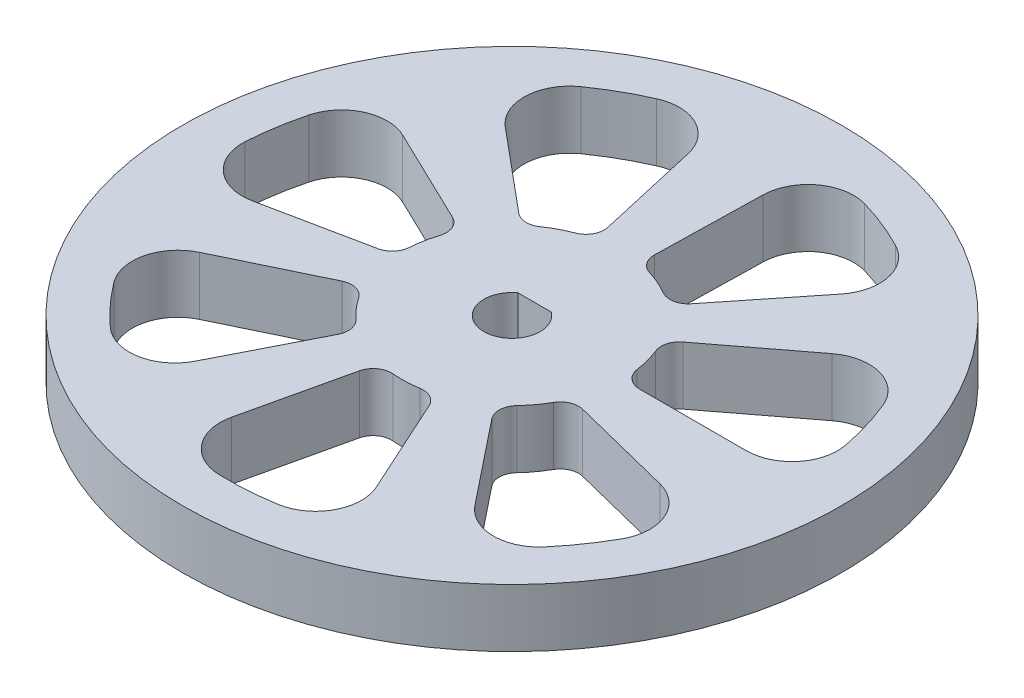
ISO-10303-21;
HEADER;
FILE_DESCRIPTION(('STEP AP214'),'2;1');
FILE_NAME('part.step','',(''),(''),'','','');
FILE_SCHEMA(('AUTOMOTIVE_DESIGN { 1 0 10303 214 1 1 1 1 }'));
ENDSEC;
DATA;
#1=APPLICATION_CONTEXT('core data for automotive mechanical design processes');
#2=APPLICATION_PROTOCOL_DEFINITION('international standard','automotive_design',2000,#1);
#3=PRODUCT_CONTEXT('',#1,'mechanical');
#4=PRODUCT('Part','Part','',(#3));
#5=PRODUCT_RELATED_PRODUCT_CATEGORY('part','',(#4));
#6=PRODUCT_DEFINITION_FORMATION('','',#4);
#7=PRODUCT_DEFINITION_CONTEXT('part definition',#1,'design');
#8=PRODUCT_DEFINITION('design','',#6,#7);
#9=PRODUCT_DEFINITION_SHAPE('','',#8);
#10=(LENGTH_UNIT() NAMED_UNIT(*) SI_UNIT(.MILLI.,.METRE.));
#11=(NAMED_UNIT(*) PLANE_ANGLE_UNIT() SI_UNIT($,.RADIAN.));
#12=(NAMED_UNIT(*) SI_UNIT($,.STERADIAN.) SOLID_ANGLE_UNIT());
#13=UNCERTAINTY_MEASURE_WITH_UNIT(LENGTH_MEASURE(1.E-05),#10,'distance_accuracy_value','');
#14=(GEOMETRIC_REPRESENTATION_CONTEXT(3) GLOBAL_UNCERTAINTY_ASSIGNED_CONTEXT((#13)) GLOBAL_UNIT_ASSIGNED_CONTEXT((#10,
#11,#12)) REPRESENTATION_CONTEXT('',''));
#15=CARTESIAN_POINT('',(0.,0.,0.));
#16=DIRECTION('',(0.,0.,1.));
#17=DIRECTION('',(1.,0.,0.));
#18=AXIS2_PLACEMENT_3D('',#15,#16,#17);
#19=CARTESIAN_POINT('',(0.,6.35,0.));
#20=DIRECTION('',(0.,1.,0.));
#21=DIRECTION('',(0.,0.,1.));
#22=AXIS2_PLACEMENT_3D('',#19,#20,#21);
#23=PLANE('',#22);
#24=CARTESIAN_POINT('',(0.,6.35,0.));
#25=DIRECTION('',(0.,1.,0.));
#26=DIRECTION('',(0.,0.,1.));
#27=AXIS2_PLACEMENT_3D('',#24,#25,#26);
#28=CIRCLE('',#27,31.0699999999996);
#29=CARTESIAN_POINT('',(-12.5949302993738,6.35,-28.4026870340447));
#30=VERTEX_POINT('',#29);
#31=CARTESIAN_POINT('',(-17.8883863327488,6.35,-25.4037504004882));
#32=VERTEX_POINT('',#31);
#33=EDGE_CURVE('E463',#30,#32,#28,.T.);
#34=ORIENTED_EDGE('',*,*,#33,.F.);
#35=CARTESIAN_POINT('',(-10.5680667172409,6.35,-23.8319295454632));
#36=DIRECTION('',(0.,1.,0.));
#37=DIRECTION('',(0.,0.,1.));
#38=AXIS2_PLACEMENT_3D('',#35,#36,#37);
#39=CIRCLE('',#38,5.);
#40=CARTESIAN_POINT('',(-5.6934271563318,6.35,-24.9445342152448));
#41=VERTEX_POINT('',#40);
#42=EDGE_CURVE('E461',#41,#30,#39,.T.);
#43=ORIENTED_EDGE('',*,*,#42,.F.);
#44=DIRECTION('',(-0.222520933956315,0.,-0.974927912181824));
#45=VECTOR('',#44,1.);
#46=CARTESIAN_POINT('',(-3.09907757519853,6.35,-13.5779460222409));
#47=LINE('',#46,#45);
#48=CARTESIAN_POINT('',(-3.09907757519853,6.35,-13.5779460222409));
#49=VERTEX_POINT('',#48);
#50=EDGE_CURVE('E477',#49,#41,#47,.T.);
#51=ORIENTED_EDGE('',*,*,#50,.F.);
#52=CARTESIAN_POINT('',(-5.04893339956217,6.35,-13.1329041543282));
#53=DIRECTION('',(0.,1.,0.));
#54=DIRECTION('',(0.,0.,1.));
#55=AXIS2_PLACEMENT_3D('',#52,#53,#54);
#56=CIRCLE('',#55,2.);
#57=CARTESIAN_POINT('',(-4.33124563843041,6.35,-11.2661089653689));
#58=VERTEX_POINT('',#57);
#59=EDGE_CURVE('E474',#58,#49,#56,.T.);
#60=ORIENTED_EDGE('',*,*,#59,.F.);
#61=CARTESIAN_POINT('',(0.,6.35,0.));
#62=DIRECTION('',(0.,-1.,0.));
#63=DIRECTION('',(0.,0.,1.));
#64=AXIS2_PLACEMENT_3D('',#61,#62,#63);
#65=CIRCLE('',#64,12.0699999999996);
#66=CARTESIAN_POINT('',(-6.86861851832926,6.35,-9.92506824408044));
#67=VERTEX_POINT('',#66);
#68=EDGE_CURVE('E472',#67,#58,#65,.T.);
#69=ORIENTED_EDGE('',*,*,#68,.F.);
#70=CARTESIAN_POINT('',(-8.00674917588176,6.35,-11.569652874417));
#71=DIRECTION('',(0.,1.,0.));
#72=DIRECTION('',(0.,0.,-1.));
#73=AXIS2_PLACEMENT_3D('',#70,#71,#72);
#74=CIRCLE('',#73,2.);
#75=CARTESIAN_POINT('',(-9.2876322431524,6.35,-10.0336390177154));
#76=VERTEX_POINT('',#75);
#77=EDGE_CURVE('E470',#76,#67,#74,.T.);
#78=ORIENTED_EDGE('',*,*,#77,.F.);
#79=DIRECTION('',(0.768006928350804,0.,0.640441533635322));
#80=VECTOR('',#79,1.);
#81=CARTESIAN_POINT('',(-9.2876322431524,6.35,-10.0336390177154));
#82=LINE('',#81,#80);
#83=CARTESIAN_POINT('',(-18.2118707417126,6.35,-17.4755679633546));
#84=VERTEX_POINT('',#83);
#85=EDGE_CURVE('E468',#84,#76,#82,.T.);
#86=ORIENTED_EDGE('',*,*,#85,.F.);
#87=CARTESIAN_POINT('',(-15.009663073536,6.35,-21.3156026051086));
#88=DIRECTION('',(0.,1.,0.));
#89=DIRECTION('',(0.,0.,-1.));
#90=AXIS2_PLACEMENT_3D('',#87,#88,#89);
#91=CIRCLE('',#90,5.);
#92=EDGE_CURVE('E466',#32,#84,#91,.T.);
#93=ORIENTED_EDGE('',*,*,#92,.F.);
#94=EDGE_LOOP('',(#34,#43,#51,#60,#69,#78,#86,#93));
#95=FACE_BOUND('',#94,.T.);
#96=CARTESIAN_POINT('',(0.,6.35,0.));
#97=DIRECTION('',(0.,1.,0.));
#98=DIRECTION('',(0.,0.,1.));
#99=AXIS2_PLACEMENT_3D('',#96,#97,#98);
#100=CIRCLE('',#99,31.0700000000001);
#101=CARTESIAN_POINT('',(-24.8879367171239,6.35,18.5993415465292));
#102=VERTEX_POINT('',#101);
#103=CARTESIAN_POINT('',(-20.7862849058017,6.35,23.092753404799));
#104=VERTEX_POINT('',#103);
#105=EDGE_CURVE('E581',#102,#104,#100,.T.);
#106=ORIENTED_EDGE('',*,*,#105,.F.);
#107=CARTESIAN_POINT('',(-20.8827972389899,6.35,15.6062064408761));
#108=DIRECTION('',(0.,1.,0.));
#109=DIRECTION('',(0.,0.,1.));
#110=AXIS2_PLACEMENT_3D('',#107,#108,#109);
#111=CIRCLE('',#110,5.);
#112=CARTESIAN_POINT('',(-23.0522159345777,6.35,11.101362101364));
#113=VERTEX_POINT('',#112);
#114=EDGE_CURVE('E579',#113,#102,#111,.T.);
#115=ORIENTED_EDGE('',*,*,#114,.F.);
#116=DIRECTION('',(-0.900968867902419,0.,0.433883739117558));
#117=VECTOR('',#116,1.);
#118=CARTESIAN_POINT('',(-12.5479089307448,6.35,6.04275446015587));
#119=LINE('',#118,#117);
#120=CARTESIAN_POINT('',(-12.5479089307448,6.35,6.04275446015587));
#121=VERTEX_POINT('',#120);
#122=EDGE_CURVE('E595',#121,#113,#119,.T.);
#123=ORIENTED_EDGE('',*,*,#122,.F.);
#124=CARTESIAN_POINT('',(-11.6801414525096,6.35,7.84469219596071));
#125=DIRECTION('',(0.,1.,0.));
#126=DIRECTION('',(0.,0.,1.));
#127=AXIS2_PLACEMENT_3D('',#124,#125,#126);
#128=CIRCLE('',#127,2.);
#129=CARTESIAN_POINT('',(-10.0198512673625,6.35,6.72959735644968));
#130=VERTEX_POINT('',#129);
#131=EDGE_CURVE('E592',#130,#121,#128,.T.);
#132=ORIENTED_EDGE('',*,*,#131,.F.);
#133=CARTESIAN_POINT('',(0.,6.35,0.));
#134=DIRECTION('',(0.,-1.,0.));
#135=DIRECTION('',(0.,0.,1.));
#136=AXIS2_PLACEMENT_3D('',#133,#134,#135);
#137=CIRCLE('',#136,12.0700000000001);
#138=CARTESIAN_POINT('',(-8.14781465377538,6.35,8.90494336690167));
#139=VERTEX_POINT('',#138);
#140=EDGE_CURVE('E590',#139,#130,#137,.T.);
#141=ORIENTED_EDGE('',*,*,#140,.F.);
#142=CARTESIAN_POINT('',(-9.49790821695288,6.35,10.3804932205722));
#143=DIRECTION('',(0.,1.,0.));
#144=DIRECTION('',(0.,0.,-1.));
#145=AXIS2_PLACEMENT_3D('',#142,#143,#144);
#146=CIRCLE('',#145,2.);
#147=CARTESIAN_POINT('',(-7.71538213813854,6.35,11.2874666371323));
#148=VERTEX_POINT('',#147);
#149=EDGE_CURVE('E588',#148,#139,#146,.T.);
#150=ORIENTED_EDGE('',*,*,#149,.F.);
#151=DIRECTION('',(0.453486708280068,0.,-0.891263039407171));
#152=VECTOR('',#151,1.);
#153=CARTESIAN_POINT('',(-7.71538213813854,6.35,11.2874666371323));
#154=LINE('',#153,#152);
#155=CARTESIAN_POINT('',(-12.9848965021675,6.35,21.6439408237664));
#156=VERTEX_POINT('',#155);
#157=EDGE_CURVE('E586',#156,#148,#154,.T.);
#158=ORIENTED_EDGE('',*,*,#157,.F.);
#159=CARTESIAN_POINT('',(-17.4412116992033,6.35,19.376507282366));
#160=DIRECTION('',(0.,1.,0.));
#161=DIRECTION('',(0.,0.,-1.));
#162=AXIS2_PLACEMENT_3D('',#159,#160,#161);
#163=CIRCLE('',#162,5.);
#164=EDGE_CURVE('E584',#104,#156,#163,.T.);
#165=ORIENTED_EDGE('',*,*,#164,.F.);
#166=EDGE_LOOP('',(#106,#115,#123,#132,#141,#150,#158,#165));
#167=FACE_BOUND('',#166,.T.);
#168=CARTESIAN_POINT('',(0.,6.35,0.));
#169=DIRECTION('',(0.,1.,0.));
#170=DIRECTION('',(0.,0.,1.));
#171=AXIS2_PLACEMENT_3D('',#168,#169,#170);
#172=CIRCLE('',#171,31.0700000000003);
#173=CARTESIAN_POINT('',(23.6711041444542,6.35,20.1252013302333));
#174=VERTEX_POINT('',#173);
#175=CARTESIAN_POINT('',(27.1391533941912,6.35,15.1265082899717));
#176=VERTEX_POINT('',#175);
#177=EDGE_CURVE('E699',#174,#176,#172,.T.);
#178=ORIENTED_EDGE('',*,*,#177,.F.);
#179=CARTESIAN_POINT('',(19.861785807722,6.35,16.8865142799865));
#180=DIRECTION('',(0.,1.,0.));
#181=DIRECTION('',(0.,0.,1.));
#182=AXIS2_PLACEMENT_3D('',#179,#180,#181);
#183=CIRCLE('',#182,5.);
#184=CARTESIAN_POINT('',(15.9526283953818,6.35,20.0039632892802));
#185=VERTEX_POINT('',#184);
#186=EDGE_CURVE('E697',#185,#174,#183,.T.);
#187=ORIENTED_EDGE('',*,*,#186,.F.);
#188=DIRECTION('',(0.623489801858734,0.,0.78183148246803));
#189=VECTOR('',#188,1.);
#190=CARTESIAN_POINT('',(8.68342240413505,6.35,10.8886672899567));
#191=LINE('',#190,#189);
#192=CARTESIAN_POINT('',(8.68342240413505,6.35,10.8886672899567));
#193=VERTEX_POINT('',#192);
#194=EDGE_CURVE('E713',#193,#185,#191,.T.);
#195=ORIENTED_EDGE('',*,*,#194,.F.);
#196=CARTESIAN_POINT('',(10.2470853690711,6.35,9.6416876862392));
#197=DIRECTION('',(0.,1.,0.));
#198=DIRECTION('',(0.,0.,1.));
#199=AXIS2_PLACEMENT_3D('',#196,#197,#198);
#200=CIRCLE('',#199,2.);
#201=CARTESIAN_POINT('',(8.79049896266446,6.35,8.2711563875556));
#202=VERTEX_POINT('',#201);
#203=EDGE_CURVE('E710',#202,#193,#200,.T.);
#204=ORIENTED_EDGE('',*,*,#203,.F.);
#205=CARTESIAN_POINT('',(0.,6.35,0.));
#206=DIRECTION('',(0.,-1.,0.));
#207=DIRECTION('',(0.,0.,1.));
#208=AXIS2_PLACEMENT_3D('',#205,#206,#207);
#209=CIRCLE('',#208,12.0700000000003);
#210=CARTESIAN_POINT('',(10.4947371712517,6.35,5.96199561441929));
#211=VERTEX_POINT('',#210);
#212=EDGE_CURVE('E708',#211,#202,#209,.T.);
#213=ORIENTED_EDGE('',*,*,#212,.F.);
#214=CARTESIAN_POINT('',(12.2337159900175,6.35,6.94989878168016));
#215=DIRECTION('',(0.,1.,0.));
#216=DIRECTION('',(0.,0.,-1.));
#217=AXIS2_PLACEMENT_3D('',#214,#215,#216);
#218=CIRCLE('',#217,2.);
#219=CARTESIAN_POINT('',(12.7213003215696,6.35,5.01024378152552));
#220=VERTEX_POINT('',#219);
#221=EDGE_CURVE('E706',#220,#211,#218,.T.);
#222=ORIENTED_EDGE('',*,*,#221,.F.);
#223=DIRECTION('',(-0.969827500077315,0.,-0.243792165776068));
#224=VECTOR('',#223,1.);
#225=CARTESIAN_POINT('',(12.7213003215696,6.35,5.01024378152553));
#226=LINE('',#225,#224);
#227=CARTESIAN_POINT('',(23.9906933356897,6.35,7.84310811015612));
#228=VERTEX_POINT('',#227);
#229=EDGE_CURVE('E704',#228,#220,#226,.T.);
#230=ORIENTED_EDGE('',*,*,#229,.F.);
#231=CARTESIAN_POINT('',(22.7717325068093,6.35,12.6922456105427));
#232=DIRECTION('',(0.,1.,0.));
#233=DIRECTION('',(0.,0.,-1.));
#234=AXIS2_PLACEMENT_3D('',#231,#232,#233);
#235=CIRCLE('',#234,5.);
#236=EDGE_CURVE('E702',#176,#228,#235,.T.);
#237=ORIENTED_EDGE('',*,*,#236,.F.);
#238=EDGE_LOOP('',(#178,#187,#195,#204,#213,#222,#230,#237));
#239=FACE_BOUND('',#238,.T.);
#240=CARTESIAN_POINT('',(0.,6.35,0.));
#241=DIRECTION('',(0.,1.,0.));
#242=DIRECTION('',(0.,0.,1.));
#243=AXIS2_PLACEMENT_3D('',#240,#241,#242);
#244=CIRCLE('',#243,31.07);
#245=CARTESIAN_POINT('',(30.4932080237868,6.35,-5.95895665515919));
#246=VERTEX_POINT('',#245);
#247=CARTESIAN_POINT('',(28.7473657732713,6.35,-11.7870208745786));
#248=VERTEX_POINT('',#247);
#249=EDGE_CURVE('E775',#246,#248,#244,.T.);
#250=ORIENTED_EDGE('',*,*,#249,.F.);
#251=CARTESIAN_POINT('',(25.5860293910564,6.35,-5.));
#252=DIRECTION('',(0.,1.,0.));
#253=DIRECTION('',(0.,0.,1.));
#254=AXIS2_PLACEMENT_3D('',#251,#252,#253);
#255=CIRCLE('',#254,5.);
#256=CARTESIAN_POINT('',(25.5860293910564,6.35,0.));
#257=VERTEX_POINT('',#256);
#258=EDGE_CURVE('E773',#257,#246,#255,.T.);
#259=ORIENTED_EDGE('',*,*,#258,.F.);
#260=DIRECTION('',(1.,0.,0.));
#261=VECTOR('',#260,1.);
#262=CARTESIAN_POINT('',(13.9271282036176,6.35,0.));
#263=LINE('',#262,#261);
#264=CARTESIAN_POINT('',(13.9271282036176,6.35,0.));
#265=VERTEX_POINT('',#264);
#266=EDGE_CURVE('E789',#265,#257,#263,.T.);
#267=ORIENTED_EDGE('',*,*,#266,.F.);
#268=CARTESIAN_POINT('',(13.9271282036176,6.35,-2.));
#269=DIRECTION('',(0.,1.,0.));
#270=DIRECTION('',(0.,0.,1.));
#271=AXIS2_PLACEMENT_3D('',#268,#269,#270);
#272=CIRCLE('',#271,2.);
#273=CARTESIAN_POINT('',(11.9474369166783,6.35,-1.71570717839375));
#274=VERTEX_POINT('',#273);
#275=EDGE_CURVE('E786',#274,#265,#272,.T.);
#276=ORIENTED_EDGE('',*,*,#275,.F.);
#277=CARTESIAN_POINT('',(0.,6.35,0.));
#278=DIRECTION('',(0.,-1.,0.));
#279=DIRECTION('',(0.,0.,1.));
#280=AXIS2_PLACEMENT_3D('',#277,#278,#279);
#281=CIRCLE('',#280,12.07);
#282=CARTESIAN_POINT('',(11.2046374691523,6.35,-4.4878724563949));
#283=VERTEX_POINT('',#282);
#284=EDGE_CURVE('E784',#283,#274,#281,.T.);
#285=ORIENTED_EDGE('',*,*,#284,.F.);
#286=CARTESIAN_POINT('',(13.0612468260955,6.35,-5.23151329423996));
#287=DIRECTION('',(0.,1.,0.));
#288=DIRECTION('',(0.,0.,-1.));
#289=AXIS2_PLACEMENT_3D('',#286,#287,#288);
#290=CIRCLE('',#289,2.);
#291=CARTESIAN_POINT('',(11.848767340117,6.35,-6.82207718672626));
#292=VERTEX_POINT('',#291);
#293=EDGE_CURVE('E782',#292,#283,#290,.T.);
#294=ORIENTED_EDGE('',*,*,#293,.F.);
#295=DIRECTION('',(-0.79528194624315,0.,0.606239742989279));
#296=VECTOR('',#295,1.);
#297=CARTESIAN_POINT('',(11.848767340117,6.35,-6.82207718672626));
#298=LINE('',#297,#296);
#299=CARTESIAN_POINT('',(21.0899414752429,6.35,-13.86658141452));
#300=VERTEX_POINT('',#299);
#301=EDGE_CURVE('E780',#300,#292,#298,.T.);
#302=ORIENTED_EDGE('',*,*,#301,.F.);
#303=CARTESIAN_POINT('',(24.1211401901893,6.35,-9.89017168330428));
#304=DIRECTION('',(0.,1.,0.));
#305=DIRECTION('',(0.,0.,-1.));
#306=AXIS2_PLACEMENT_3D('',#303,#304,#305);
#307=CIRCLE('',#306,5.);
#308=EDGE_CURVE('E778',#248,#300,#307,.T.);
#309=ORIENTED_EDGE('',*,*,#308,.F.);
#310=EDGE_LOOP('',(#250,#259,#267,#276,#285,#294,#302,#309));
#311=FACE_BOUND('',#310,.T.);
#312=CARTESIAN_POINT('',(0.,6.35,0.));
#313=DIRECTION('',(0.,1.,0.));
#314=DIRECTION('',(0.,0.,1.));
#315=AXIS2_PLACEMENT_3D('',#312,#313,#314);
#316=CIRCLE('',#315,36.);
#317=CARTESIAN_POINT('',(0.,6.35,36.));
#318=VERTEX_POINT('',#317);
#319=EDGE_CURVE('E11',#318,#318,#316,.T.);
#320=ORIENTED_EDGE('',*,*,#319,.T.);
#321=EDGE_LOOP('',(#320));
#322=FACE_BOUND('',#321,.T.);
#323=DIRECTION('',(-1.,0.,0.));
#324=VECTOR('',#323,1.);
#325=CARTESIAN_POINT('',(1.83187666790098,6.35,-2.46356));
#326=LINE('',#325,#324);
#327=CARTESIAN_POINT('',(1.83187666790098,6.35,-2.46356));
#328=VERTEX_POINT('',#327);
#329=CARTESIAN_POINT('',(-1.83187666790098,6.35,-2.46356));
#330=VERTEX_POINT('',#329);
#331=EDGE_CURVE('E759',#328,#330,#326,.T.);
#332=ORIENTED_EDGE('',*,*,#331,.F.);
#333=CARTESIAN_POINT('',(0.,6.35,0.));
#334=DIRECTION('',(0.,1.,0.));
#335=DIRECTION('',(0.,0.,1.));
#336=AXIS2_PLACEMENT_3D('',#333,#334,#335);
#337=CIRCLE('',#336,3.07);
#338=EDGE_CURVE('E756',#330,#328,#337,.T.);
#339=ORIENTED_EDGE('',*,*,#338,.F.);
#340=EDGE_LOOP('',(#332,#339));
#341=FACE_BOUND('',#340,.T.);
#342=CARTESIAN_POINT('',(0.,6.35,0.));
#343=DIRECTION('',(0.,1.,0.));
#344=DIRECTION('',(0.,0.,1.));
#345=AXIS2_PLACEMENT_3D('',#342,#343,#344);
#346=CIRCLE('',#345,31.0700000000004);
#347=CARTESIAN_POINT('',(-0.975823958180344,6.35,31.0546722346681));
#348=VERTEX_POINT('',#347);
#349=CARTESIAN_POINT('',(5.09460497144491,6.35,30.6494681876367));
#350=VERTEX_POINT('',#349);
#351=EDGE_CURVE('E640',#348,#350,#346,.T.);
#352=ORIENTED_EDGE('',*,*,#351,.F.);
#353=CARTESIAN_POINT('',(-0.818787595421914,6.35,26.0571388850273));
#354=DIRECTION('',(0.,1.,0.));
#355=DIRECTION('',(0.,0.,1.));
#356=AXIS2_PLACEMENT_3D('',#353,#354,#355);
#357=CIRCLE('',#356,5.);
#358=CARTESIAN_POINT('',(-5.69342715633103,6.35,24.9445342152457));
#359=VERTEX_POINT('',#358);
#360=EDGE_CURVE('E638',#359,#348,#357,.T.);
#361=ORIENTED_EDGE('',*,*,#360,.F.);
#362=DIRECTION('',(-0.222520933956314,0.,0.974927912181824));
#363=VECTOR('',#362,1.);
#364=CARTESIAN_POINT('',(-3.09907757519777,6.35,13.5779460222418));
#365=LINE('',#364,#363);
#366=CARTESIAN_POINT('',(-3.09907757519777,6.35,13.5779460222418));
#367=VERTEX_POINT('',#366);
#368=EDGE_CURVE('E654',#367,#359,#365,.T.);
#369=ORIENTED_EDGE('',*,*,#368,.F.);
#370=CARTESIAN_POINT('',(-1.14922175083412,6.35,14.0229878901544));
#371=DIRECTION('',(0.,1.,0.));
#372=DIRECTION('',(0.,0.,1.));
#373=AXIS2_PLACEMENT_3D('',#370,#371,#372);
#374=CIRCLE('',#373,2.);
#375=CARTESIAN_POINT('',(-0.98586400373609,6.35,12.0296704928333));
#376=VERTEX_POINT('',#375);
#377=EDGE_CURVE('E651',#376,#367,#374,.T.);
#378=ORIENTED_EDGE('',*,*,#377,.F.);
#379=CARTESIAN_POINT('',(0.,6.35,0.));
#380=DIRECTION('',(0.,-1.,0.));
#381=DIRECTION('',(0.,0.,1.));
#382=AXIS2_PLACEMENT_3D('',#379,#380,#381);
#383=CIRCLE('',#382,12.0700000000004);
#384=CARTESIAN_POINT('',(1.88208572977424,6.35,11.922359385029));
#385=VERTEX_POINT('',#384);
#386=EDGE_CURVE('E649',#385,#376,#383,.T.);
#387=ORIENTED_EDGE('',*,*,#386,.F.);
#388=CARTESIAN_POINT('',(2.19394749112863,6.35,13.8978953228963));
#389=DIRECTION('',(0.,1.,0.));
#390=DIRECTION('',(0.,0.,-1.));
#391=AXIS2_PLACEMENT_3D('',#388,#389,#390);
#392=CIRCLE('',#391,2.);
#393=CARTESIAN_POINT('',(4.01443469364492,6.35,13.0697489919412));
#394=VERTEX_POINT('',#393);
#395=EDGE_CURVE('E647',#394,#385,#392,.T.);
#396=ORIENTED_EDGE('',*,*,#395,.F.);
#397=DIRECTION('',(-0.414073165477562,0.,-0.910243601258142));
#398=VECTOR('',#397,1.);
#399=CARTESIAN_POINT('',(4.01443469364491,6.35,13.0697489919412));
#400=LINE('',#399,#398);
#401=CARTESIAN_POINT('',(8.82596379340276,6.35,23.646777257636));
#402=VERTEX_POINT('',#401);
#403=EDGE_CURVE('E645',#402,#394,#400,.T.);
#404=ORIENTED_EDGE('',*,*,#403,.F.);
#405=CARTESIAN_POINT('',(4.27474578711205,6.35,25.7171430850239));
#406=DIRECTION('',(0.,1.,0.));
#407=DIRECTION('',(0.,0.,-1.));
#408=AXIS2_PLACEMENT_3D('',#405,#406,#407);
#409=CIRCLE('',#408,5.);
#410=EDGE_CURVE('E643',#350,#402,#409,.T.);
#411=ORIENTED_EDGE('',*,*,#410,.F.);
#412=EDGE_LOOP('',(#352,#361,#369,#378,#387,#396,#404,#411));
#413=FACE_BOUND('',#412,.T.);
#414=CARTESIAN_POINT('',(0.,6.35,0.));
#415=DIRECTION('',(0.,1.,0.));
#416=DIRECTION('',(0.,0.,1.));
#417=AXIS2_PLACEMENT_3D('',#414,#415,#416);
#418=CIRCLE('',#417,31.0699999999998);
#419=CARTESIAN_POINT('',(-30.0589255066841,6.35,-7.861672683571));
#420=VERTEX_POINT('',#419);
#421=CARTESIAN_POINT('',(-31.0146782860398,6.35,-1.853275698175));
#422=VERTEX_POINT('',#421);
#423=EDGE_CURVE('E522',#420,#422,#418,.T.);
#424=ORIENTED_EDGE('',*,*,#423,.F.);
#425=CARTESIAN_POINT('',(-25.2216346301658,6.35,-6.59651776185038));
#426=DIRECTION('',(0.,1.,0.));
#427=DIRECTION('',(0.,0.,1.));
#428=AXIS2_PLACEMENT_3D('',#425,#426,#427);
#429=CIRCLE('',#428,5.);
#430=CARTESIAN_POINT('',(-23.052215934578,6.35,-11.1013621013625));
#431=VERTEX_POINT('',#430);
#432=EDGE_CURVE('E520',#431,#420,#429,.T.);
#433=ORIENTED_EDGE('',*,*,#432,.F.);
#434=DIRECTION('',(-0.900968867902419,0.,-0.433883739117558));
#435=VECTOR('',#434,1.);
#436=CARTESIAN_POINT('',(-12.5479089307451,6.35,-6.0427544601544));
#437=LINE('',#436,#435);
#438=CARTESIAN_POINT('',(-12.5479089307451,6.35,-6.0427544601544));
#439=VERTEX_POINT('',#438);
#440=EDGE_CURVE('E536',#439,#431,#437,.T.);
#441=ORIENTED_EDGE('',*,*,#440,.F.);
#442=CARTESIAN_POINT('',(-13.4156764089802,6.35,-4.24081672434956));
#443=DIRECTION('',(0.,1.,0.));
#444=DIRECTION('',(0.,0.,1.));
#445=AXIS2_PLACEMENT_3D('',#442,#443,#444);
#446=CIRCLE('',#445,2.);
#447=CARTESIAN_POINT('',(-11.5086861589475,6.35,-3.63799984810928));
#448=VERTEX_POINT('',#447);
#449=EDGE_CURVE('E533',#448,#439,#446,.T.);
#450=ORIENTED_EDGE('',*,*,#449,.F.);
#451=CARTESIAN_POINT('',(0.,6.35,0.));
#452=DIRECTION('',(0.,-1.,0.));
#453=DIRECTION('',(0.,0.,1.));
#454=AXIS2_PLACEMENT_3D('',#451,#452,#453);
#455=CIRCLE('',#454,12.0699999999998);
#456=CARTESIAN_POINT('',(-12.0422444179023,6.35,-0.818076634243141));
#457=VERTEX_POINT('',#456);
#458=EDGE_CURVE('E531',#457,#448,#455,.T.);
#459=ORIENTED_EDGE('',*,*,#458,.F.);
#460=CARTESIAN_POINT('',(-14.0376453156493,6.35,-0.953632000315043));
#461=DIRECTION('',(0.,1.,0.));
#462=DIRECTION('',(0.,0.,-1.));
#463=AXIS2_PLACEMENT_3D('',#460,#461,#462);
#464=CIRCLE('',#463,2.);
#465=CARTESIAN_POINT('',(-13.6353588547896,6.35,1.00549168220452));
#466=VERTEX_POINT('',#465);
#467=EDGE_CURVE('E529',#466,#457,#464,.T.);
#468=ORIENTED_EDGE('',*,*,#467,.F.);
#469=DIRECTION('',(0.97956184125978,0.,-0.201143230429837));
#470=VECTOR('',#469,1.);
#471=CARTESIAN_POINT('',(-13.6353588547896,6.35,1.00549168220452));
#472=LINE('',#471,#470);
#473=CARTESIAN_POINT('',(-25.0178648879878,6.35,3.34277549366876));
#474=VERTEX_POINT('',#473);
#475=EDGE_CURVE('E527',#474,#466,#472,.T.);
#476=ORIENTED_EDGE('',*,*,#475,.F.);
#477=CARTESIAN_POINT('',(-26.023581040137,6.35,-1.55503371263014));
#478=DIRECTION('',(0.,1.,0.));
#479=DIRECTION('',(0.,0.,-1.));
#480=AXIS2_PLACEMENT_3D('',#477,#478,#479);
#481=CIRCLE('',#480,5.);
#482=EDGE_CURVE('E525',#422,#474,#481,.T.);
#483=ORIENTED_EDGE('',*,*,#482,.F.);
#484=EDGE_LOOP('',(#424,#433,#441,#450,#459,#468,#476,#483));
#485=FACE_BOUND('',#484,.T.);
#486=CARTESIAN_POINT('',(0.,6.35,0.));
#487=DIRECTION('',(0.,1.,0.));
#488=DIRECTION('',(0.,0.,1.));
#489=AXIS2_PLACEMENT_3D('',#486,#487,#488);
#490=CIRCLE('',#489,31.0699999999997);
#491=CARTESIAN_POINT('',(14.3533043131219,6.35,-27.555898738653));
#492=VERTEX_POINT('',#491);
#493=CARTESIAN_POINT('',(8.7082253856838,6.35,-29.8246829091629));
#494=VERTEX_POINT('',#493);
#495=EDGE_CURVE('E404',#492,#494,#490,.T.);
#496=ORIENTED_EDGE('',*,*,#495,.F.);
#497=CARTESIAN_POINT('',(12.0434709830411,6.35,-23.1214122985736));
#498=DIRECTION('',(0.,1.,0.));
#499=DIRECTION('',(0.,0.,1.));
#500=AXIS2_PLACEMENT_3D('',#497,#498,#499);
#501=CIRCLE('',#500,5.);
#502=CARTESIAN_POINT('',(15.9526283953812,6.35,-20.0039632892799));
#503=VERTEX_POINT('',#502);
#504=EDGE_CURVE('E396',#503,#492,#501,.T.);
#505=ORIENTED_EDGE('',*,*,#504,.F.);
#506=DIRECTION('',(0.623489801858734,0.,-0.78183148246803));
#507=VECTOR('',#506,1.);
#508=CARTESIAN_POINT('',(8.68342240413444,6.35,-10.8886672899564));
#509=LINE('',#508,#507);
#510=CARTESIAN_POINT('',(8.68342240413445,6.35,-10.8886672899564));
#511=VERTEX_POINT('',#510);
#512=EDGE_CURVE('E429',#511,#503,#509,.T.);
#513=ORIENTED_EDGE('',*,*,#512,.F.);
#514=CARTESIAN_POINT('',(7.11975943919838,6.35,-12.1356468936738));
#515=DIRECTION('',(0.,1.,0.));
#516=DIRECTION('',(0.,0.,1.));
#517=AXIS2_PLACEMENT_3D('',#514,#515,#516);
#518=CIRCLE('',#517,2.);
#519=CARTESIAN_POINT('',(6.10771118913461,6.35,-10.410608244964));
#520=VERTEX_POINT('',#519);
#521=EDGE_CURVE('E427',#520,#511,#518,.T.);
#522=ORIENTED_EDGE('',*,*,#521,.F.);
#523=CARTESIAN_POINT('',(0.,6.35,0.));
#524=DIRECTION('',(0.,-1.,0.));
#525=DIRECTION('',(0.,0.,1.));
#526=AXIS2_PLACEMENT_3D('',#523,#524,#525);
#527=CIRCLE('',#526,12.0699999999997);
#528=CARTESIAN_POINT('',(3.47721721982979,6.35,-11.5582810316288));
#529=VERTEX_POINT('',#528);
#530=EDGE_CURVE('E425',#529,#520,#527,.T.);
#531=ORIENTED_EDGE('',*,*,#530,.F.);
#532=CARTESIAN_POINT('',(4.05339240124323,6.35,-13.4734891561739));
#533=DIRECTION('',(0.,1.,0.));
#534=DIRECTION('',(0.,0.,-1.));
#535=AXIS2_PLACEMENT_3D('',#532,#533,#534);
#536=CIRCLE('',#535,2.);
#537=CARTESIAN_POINT('',(2.05387088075,6.35,-13.5172348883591));
#538=VERTEX_POINT('',#537);
#539=EDGE_CURVE('E423',#538,#529,#536,.T.);
#540=ORIENTED_EDGE('',*,*,#539,.F.);
#541=DIRECTION('',(-0.0218728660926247,0.,0.999760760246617));
#542=VECTOR('',#541,1.);
#543=CARTESIAN_POINT('',(2.05387088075,6.35,-13.5172348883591));
#544=LINE('',#543,#542);
#545=CARTESIAN_POINT('',(2.30803352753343,6.35,-25.13445230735));
#546=VERTEX_POINT('',#545);
#547=EDGE_CURVE('E419',#546,#538,#544,.T.);
#548=ORIENTED_EDGE('',*,*,#547,.F.);
#549=CARTESIAN_POINT('',(7.30683732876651,6.35,-25.0250879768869));
#550=DIRECTION('',(0.,1.,0.));
#551=DIRECTION('',(0.,0.,-1.));
#552=AXIS2_PLACEMENT_3D('',#549,#550,#551);
#553=CIRCLE('',#552,5.);
#554=EDGE_CURVE('E417',#494,#546,#553,.T.);
#555=ORIENTED_EDGE('',*,*,#554,.F.);
#556=EDGE_LOOP('',(#496,#505,#513,#522,#531,#540,#548,#555));
#557=FACE_BOUND('',#556,.T.);
#558=ADVANCED_FACE('F31',(#95,#167,#239,#311,#322,#341,#413,#485,#557),#23,.T.);
#559=CARTESIAN_POINT('',(0.,0.,0.));
#560=DIRECTION('',(0.,1.,0.));
#561=DIRECTION('',(0.,0.,1.));
#562=AXIS2_PLACEMENT_3D('',#559,#560,#561);
#563=PLANE('',#562);
#564=CARTESIAN_POINT('',(-10.5680667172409,0.,-23.8319295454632));
#565=DIRECTION('',(0.,1.,0.));
#566=DIRECTION('',(0.,0.,1.));
#567=AXIS2_PLACEMENT_3D('',#564,#565,#566);
#568=CIRCLE('',#567,5.);
#569=CARTESIAN_POINT('',(-5.6934271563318,0.,-24.9445342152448));
#570=VERTEX_POINT('',#569);
#571=CARTESIAN_POINT('',(-12.5949302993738,0.,-28.4026870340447));
#572=VERTEX_POINT('',#571);
#573=EDGE_CURVE('E412',#570,#572,#568,.T.);
#574=ORIENTED_EDGE('',*,*,#573,.T.);
#575=CARTESIAN_POINT('',(0.,0.,0.));
#576=DIRECTION('',(0.,1.,0.));
#577=DIRECTION('',(0.,0.,1.));
#578=AXIS2_PLACEMENT_3D('',#575,#576,#577);
#579=CIRCLE('',#578,31.0699999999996);
#580=CARTESIAN_POINT('',(-17.8883863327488,0.,-25.4037504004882));
#581=VERTEX_POINT('',#580);
#582=EDGE_CURVE('E482',#572,#581,#579,.T.);
#583=ORIENTED_EDGE('',*,*,#582,.T.);
#584=CARTESIAN_POINT('',(-15.009663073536,0.,-21.3156026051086));
#585=DIRECTION('',(0.,1.,0.));
#586=DIRECTION('',(0.,0.,-1.));
#587=AXIS2_PLACEMENT_3D('',#584,#585,#586);
#588=CIRCLE('',#587,5.);
#589=CARTESIAN_POINT('',(-18.2118707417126,0.,-17.4755679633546));
#590=VERTEX_POINT('',#589);
#591=EDGE_CURVE('E485',#581,#590,#588,.T.);
#592=ORIENTED_EDGE('',*,*,#591,.T.);
#593=DIRECTION('',(0.768006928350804,0.,0.640441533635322));
#594=VECTOR('',#593,1.);
#595=CARTESIAN_POINT('',(-9.2876322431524,0.,-10.0336390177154));
#596=LINE('',#595,#594);
#597=CARTESIAN_POINT('',(-9.2876322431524,0.,-10.0336390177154));
#598=VERTEX_POINT('',#597);
#599=EDGE_CURVE('E488',#590,#598,#596,.T.);
#600=ORIENTED_EDGE('',*,*,#599,.T.);
#601=CARTESIAN_POINT('',(-8.00674917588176,0.,-11.569652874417));
#602=DIRECTION('',(0.,1.,0.));
#603=DIRECTION('',(0.,0.,-1.));
#604=AXIS2_PLACEMENT_3D('',#601,#602,#603);
#605=CIRCLE('',#604,2.);
#606=CARTESIAN_POINT('',(-6.86861851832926,0.,-9.92506824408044));
#607=VERTEX_POINT('',#606);
#608=EDGE_CURVE('E491',#598,#607,#605,.T.);
#609=ORIENTED_EDGE('',*,*,#608,.T.);
#610=CARTESIAN_POINT('',(0.,0.,0.));
#611=DIRECTION('',(0.,-1.,0.));
#612=DIRECTION('',(0.,0.,1.));
#613=AXIS2_PLACEMENT_3D('',#610,#611,#612);
#614=CIRCLE('',#613,12.0699999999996);
#615=CARTESIAN_POINT('',(-4.33124563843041,0.,-11.2661089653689));
#616=VERTEX_POINT('',#615);
#617=EDGE_CURVE('E494',#607,#616,#614,.T.);
#618=ORIENTED_EDGE('',*,*,#617,.T.);
#619=CARTESIAN_POINT('',(-5.04893339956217,0.,-13.1329041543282));
#620=DIRECTION('',(0.,1.,0.));
#621=DIRECTION('',(0.,0.,1.));
#622=AXIS2_PLACEMENT_3D('',#619,#620,#621);
#623=CIRCLE('',#622,2.);
#624=CARTESIAN_POINT('',(-3.09907757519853,0.,-13.5779460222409));
#625=VERTEX_POINT('',#624);
#626=EDGE_CURVE('E497',#616,#625,#623,.T.);
#627=ORIENTED_EDGE('',*,*,#626,.T.);
#628=DIRECTION('',(-0.222520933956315,0.,-0.974927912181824));
#629=VECTOR('',#628,1.);
#630=CARTESIAN_POINT('',(-3.09907757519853,0.,-13.5779460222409));
#631=LINE('',#630,#629);
#632=EDGE_CURVE('E464',#625,#570,#631,.T.);
#633=ORIENTED_EDGE('',*,*,#632,.T.);
#634=EDGE_LOOP('',(#574,#583,#592,#600,#609,#618,#627,#633));
#635=FACE_BOUND('',#634,.T.);
#636=CARTESIAN_POINT('',(-20.8827972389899,0.,15.6062064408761));
#637=DIRECTION('',(0.,1.,0.));
#638=DIRECTION('',(0.,0.,1.));
#639=AXIS2_PLACEMENT_3D('',#636,#637,#638);
#640=CIRCLE('',#639,5.);
#641=CARTESIAN_POINT('',(-23.0522159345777,0.,11.101362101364));
#642=VERTEX_POINT('',#641);
#643=CARTESIAN_POINT('',(-24.8879367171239,0.,18.5993415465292));
#644=VERTEX_POINT('',#643);
#645=EDGE_CURVE('E578',#642,#644,#640,.T.);
#646=ORIENTED_EDGE('',*,*,#645,.T.);
#647=CARTESIAN_POINT('',(0.,0.,0.));
#648=DIRECTION('',(0.,1.,0.));
#649=DIRECTION('',(0.,0.,1.));
#650=AXIS2_PLACEMENT_3D('',#647,#648,#649);
#651=CIRCLE('',#650,31.0700000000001);
#652=CARTESIAN_POINT('',(-20.7862849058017,0.,23.092753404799));
#653=VERTEX_POINT('',#652);
#654=EDGE_CURVE('E600',#644,#653,#651,.T.);
#655=ORIENTED_EDGE('',*,*,#654,.T.);
#656=CARTESIAN_POINT('',(-17.4412116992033,0.,19.376507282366));
#657=DIRECTION('',(0.,1.,0.));
#658=DIRECTION('',(0.,0.,-1.));
#659=AXIS2_PLACEMENT_3D('',#656,#657,#658);
#660=CIRCLE('',#659,5.);
#661=CARTESIAN_POINT('',(-12.9848965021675,0.,21.6439408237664));
#662=VERTEX_POINT('',#661);
#663=EDGE_CURVE('E603',#653,#662,#660,.T.);
#664=ORIENTED_EDGE('',*,*,#663,.T.);
#665=DIRECTION('',(0.453486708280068,0.,-0.891263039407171));
#666=VECTOR('',#665,1.);
#667=CARTESIAN_POINT('',(-7.71538213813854,0.,11.2874666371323));
#668=LINE('',#667,#666);
#669=CARTESIAN_POINT('',(-7.71538213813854,0.,11.2874666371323));
#670=VERTEX_POINT('',#669);
#671=EDGE_CURVE('E606',#662,#670,#668,.T.);
#672=ORIENTED_EDGE('',*,*,#671,.T.);
#673=CARTESIAN_POINT('',(-9.49790821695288,0.,10.3804932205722));
#674=DIRECTION('',(0.,1.,0.));
#675=DIRECTION('',(0.,0.,-1.));
#676=AXIS2_PLACEMENT_3D('',#673,#674,#675);
#677=CIRCLE('',#676,2.);
#678=CARTESIAN_POINT('',(-8.14781465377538,0.,8.90494336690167));
#679=VERTEX_POINT('',#678);
#680=EDGE_CURVE('E609',#670,#679,#677,.T.);
#681=ORIENTED_EDGE('',*,*,#680,.T.);
#682=CARTESIAN_POINT('',(0.,0.,0.));
#683=DIRECTION('',(0.,-1.,0.));
#684=DIRECTION('',(0.,0.,1.));
#685=AXIS2_PLACEMENT_3D('',#682,#683,#684);
#686=CIRCLE('',#685,12.0700000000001);
#687=CARTESIAN_POINT('',(-10.0198512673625,0.,6.72959735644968));
#688=VERTEX_POINT('',#687);
#689=EDGE_CURVE('E612',#679,#688,#686,.T.);
#690=ORIENTED_EDGE('',*,*,#689,.T.);
#691=CARTESIAN_POINT('',(-11.6801414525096,0.,7.84469219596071));
#692=DIRECTION('',(0.,1.,0.));
#693=DIRECTION('',(0.,0.,1.));
#694=AXIS2_PLACEMENT_3D('',#691,#692,#693);
#695=CIRCLE('',#694,2.);
#696=CARTESIAN_POINT('',(-12.5479089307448,0.,6.04275446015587));
#697=VERTEX_POINT('',#696);
#698=EDGE_CURVE('E615',#688,#697,#695,.T.);
#699=ORIENTED_EDGE('',*,*,#698,.T.);
#700=DIRECTION('',(-0.900968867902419,0.,0.433883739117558));
#701=VECTOR('',#700,1.);
#702=CARTESIAN_POINT('',(-12.5479089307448,0.,6.04275446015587));
#703=LINE('',#702,#701);
#704=EDGE_CURVE('E582',#697,#642,#703,.T.);
#705=ORIENTED_EDGE('',*,*,#704,.T.);
#706=EDGE_LOOP('',(#646,#655,#664,#672,#681,#690,#699,#705));
#707=FACE_BOUND('',#706,.T.);
#708=CARTESIAN_POINT('',(19.861785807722,0.,16.8865142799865));
#709=DIRECTION('',(0.,1.,0.));
#710=DIRECTION('',(0.,0.,1.));
#711=AXIS2_PLACEMENT_3D('',#708,#709,#710);
#712=CIRCLE('',#711,5.);
#713=CARTESIAN_POINT('',(15.9526283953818,0.,20.0039632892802));
#714=VERTEX_POINT('',#713);
#715=CARTESIAN_POINT('',(23.6711041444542,0.,20.1252013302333));
#716=VERTEX_POINT('',#715);
#717=EDGE_CURVE('E696',#714,#716,#712,.T.);
#718=ORIENTED_EDGE('',*,*,#717,.T.);
#719=CARTESIAN_POINT('',(0.,0.,0.));
#720=DIRECTION('',(0.,1.,0.));
#721=DIRECTION('',(0.,0.,1.));
#722=AXIS2_PLACEMENT_3D('',#719,#720,#721);
#723=CIRCLE('',#722,31.0700000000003);
#724=CARTESIAN_POINT('',(27.1391533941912,0.,15.1265082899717));
#725=VERTEX_POINT('',#724);
#726=EDGE_CURVE('E718',#716,#725,#723,.T.);
#727=ORIENTED_EDGE('',*,*,#726,.T.);
#728=CARTESIAN_POINT('',(22.7717325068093,0.,12.6922456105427));
#729=DIRECTION('',(0.,1.,0.));
#730=DIRECTION('',(0.,0.,-1.));
#731=AXIS2_PLACEMENT_3D('',#728,#729,#730);
#732=CIRCLE('',#731,5.);
#733=CARTESIAN_POINT('',(23.9906933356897,0.,7.84310811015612));
#734=VERTEX_POINT('',#733);
#735=EDGE_CURVE('E721',#725,#734,#732,.T.);
#736=ORIENTED_EDGE('',*,*,#735,.T.);
#737=DIRECTION('',(-0.969827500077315,0.,-0.243792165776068));
#738=VECTOR('',#737,1.);
#739=CARTESIAN_POINT('',(12.7213003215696,0.,5.01024378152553));
#740=LINE('',#739,#738);
#741=CARTESIAN_POINT('',(12.7213003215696,0.,5.01024378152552));
#742=VERTEX_POINT('',#741);
#743=EDGE_CURVE('E724',#734,#742,#740,.T.);
#744=ORIENTED_EDGE('',*,*,#743,.T.);
#745=CARTESIAN_POINT('',(12.2337159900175,0.,6.94989878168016));
#746=DIRECTION('',(0.,1.,0.));
#747=DIRECTION('',(0.,0.,-1.));
#748=AXIS2_PLACEMENT_3D('',#745,#746,#747);
#749=CIRCLE('',#748,2.);
#750=CARTESIAN_POINT('',(10.4947371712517,0.,5.96199561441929));
#751=VERTEX_POINT('',#750);
#752=EDGE_CURVE('E727',#742,#751,#749,.T.);
#753=ORIENTED_EDGE('',*,*,#752,.T.);
#754=CARTESIAN_POINT('',(0.,0.,0.));
#755=DIRECTION('',(0.,-1.,0.));
#756=DIRECTION('',(0.,0.,1.));
#757=AXIS2_PLACEMENT_3D('',#754,#755,#756);
#758=CIRCLE('',#757,12.0700000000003);
#759=CARTESIAN_POINT('',(8.79049896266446,0.,8.2711563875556));
#760=VERTEX_POINT('',#759);
#761=EDGE_CURVE('E730',#751,#760,#758,.T.);
#762=ORIENTED_EDGE('',*,*,#761,.T.);
#763=CARTESIAN_POINT('',(10.2470853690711,0.,9.6416876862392));
#764=DIRECTION('',(0.,1.,0.));
#765=DIRECTION('',(0.,0.,1.));
#766=AXIS2_PLACEMENT_3D('',#763,#764,#765);
#767=CIRCLE('',#766,2.);
#768=CARTESIAN_POINT('',(8.68342240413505,0.,10.8886672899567));
#769=VERTEX_POINT('',#768);
#770=EDGE_CURVE('E733',#760,#769,#767,.T.);
#771=ORIENTED_EDGE('',*,*,#770,.T.);
#772=DIRECTION('',(0.623489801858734,0.,0.78183148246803));
#773=VECTOR('',#772,1.);
#774=CARTESIAN_POINT('',(8.68342240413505,0.,10.8886672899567));
#775=LINE('',#774,#773);
#776=EDGE_CURVE('E700',#769,#714,#775,.T.);
#777=ORIENTED_EDGE('',*,*,#776,.T.);
#778=EDGE_LOOP('',(#718,#727,#736,#744,#753,#762,#771,#777));
#779=FACE_BOUND('',#778,.T.);
#780=CARTESIAN_POINT('',(25.5860293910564,0.,-5.));
#781=DIRECTION('',(0.,1.,0.));
#782=DIRECTION('',(0.,0.,1.));
#783=AXIS2_PLACEMENT_3D('',#780,#781,#782);
#784=CIRCLE('',#783,5.);
#785=CARTESIAN_POINT('',(25.5860293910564,0.,0.));
#786=VERTEX_POINT('',#785);
#787=CARTESIAN_POINT('',(30.4932080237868,0.,-5.95895665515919));
#788=VERTEX_POINT('',#787);
#789=EDGE_CURVE('E772',#786,#788,#784,.T.);
#790=ORIENTED_EDGE('',*,*,#789,.T.);
#791=CARTESIAN_POINT('',(0.,0.,0.));
#792=DIRECTION('',(0.,1.,0.));
#793=DIRECTION('',(0.,0.,1.));
#794=AXIS2_PLACEMENT_3D('',#791,#792,#793);
#795=CIRCLE('',#794,31.07);
#796=CARTESIAN_POINT('',(28.7473657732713,0.,-11.7870208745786));
#797=VERTEX_POINT('',#796);
#798=EDGE_CURVE('E794',#788,#797,#795,.T.);
#799=ORIENTED_EDGE('',*,*,#798,.T.);
#800=CARTESIAN_POINT('',(24.1211401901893,0.,-9.89017168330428));
#801=DIRECTION('',(0.,1.,0.));
#802=DIRECTION('',(0.,0.,-1.));
#803=AXIS2_PLACEMENT_3D('',#800,#801,#802);
#804=CIRCLE('',#803,5.);
#805=CARTESIAN_POINT('',(21.0899414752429,0.,-13.86658141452));
#806=VERTEX_POINT('',#805);
#807=EDGE_CURVE('E797',#797,#806,#804,.T.);
#808=ORIENTED_EDGE('',*,*,#807,.T.);
#809=DIRECTION('',(-0.79528194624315,0.,0.606239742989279));
#810=VECTOR('',#809,1.);
#811=CARTESIAN_POINT('',(11.848767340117,0.,-6.82207718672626));
#812=LINE('',#811,#810);
#813=CARTESIAN_POINT('',(11.848767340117,0.,-6.82207718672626));
#814=VERTEX_POINT('',#813);
#815=EDGE_CURVE('E800',#806,#814,#812,.T.);
#816=ORIENTED_EDGE('',*,*,#815,.T.);
#817=CARTESIAN_POINT('',(13.0612468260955,0.,-5.23151329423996));
#818=DIRECTION('',(0.,1.,0.));
#819=DIRECTION('',(0.,0.,-1.));
#820=AXIS2_PLACEMENT_3D('',#817,#818,#819);
#821=CIRCLE('',#820,2.);
#822=CARTESIAN_POINT('',(11.2046374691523,0.,-4.4878724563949));
#823=VERTEX_POINT('',#822);
#824=EDGE_CURVE('E803',#814,#823,#821,.T.);
#825=ORIENTED_EDGE('',*,*,#824,.T.);
#826=CARTESIAN_POINT('',(0.,0.,0.));
#827=DIRECTION('',(0.,-1.,0.));
#828=DIRECTION('',(0.,0.,1.));
#829=AXIS2_PLACEMENT_3D('',#826,#827,#828);
#830=CIRCLE('',#829,12.07);
#831=CARTESIAN_POINT('',(11.9474369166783,0.,-1.71570717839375));
#832=VERTEX_POINT('',#831);
#833=EDGE_CURVE('E806',#823,#832,#830,.T.);
#834=ORIENTED_EDGE('',*,*,#833,.T.);
#835=CARTESIAN_POINT('',(13.9271282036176,0.,-2.));
#836=DIRECTION('',(0.,1.,0.));
#837=DIRECTION('',(0.,0.,1.));
#838=AXIS2_PLACEMENT_3D('',#835,#836,#837);
#839=CIRCLE('',#838,2.);
#840=CARTESIAN_POINT('',(13.9271282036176,0.,0.));
#841=VERTEX_POINT('',#840);
#842=EDGE_CURVE('E809',#832,#841,#839,.T.);
#843=ORIENTED_EDGE('',*,*,#842,.T.);
#844=DIRECTION('',(1.,0.,0.));
#845=VECTOR('',#844,1.);
#846=CARTESIAN_POINT('',(13.9271282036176,0.,0.));
#847=LINE('',#846,#845);
#848=EDGE_CURVE('E776',#841,#786,#847,.T.);
#849=ORIENTED_EDGE('',*,*,#848,.T.);
#850=EDGE_LOOP('',(#790,#799,#808,#816,#825,#834,#843,#849));
#851=FACE_BOUND('',#850,.T.);
#852=CARTESIAN_POINT('',(0.,0.,0.));
#853=DIRECTION('',(0.,1.,0.));
#854=DIRECTION('',(0.,0.,1.));
#855=AXIS2_PLACEMENT_3D('',#852,#853,#854);
#856=CIRCLE('',#855,36.);
#857=CARTESIAN_POINT('',(0.,0.,36.));
#858=VERTEX_POINT('',#857);
#859=EDGE_CURVE('E35',#858,#858,#856,.T.);
#860=ORIENTED_EDGE('',*,*,#859,.F.);
#861=EDGE_LOOP('',(#860));
#862=FACE_BOUND('',#861,.T.);
#863=CARTESIAN_POINT('',(0.,0.,0.));
#864=DIRECTION('',(0.,1.,0.));
#865=DIRECTION('',(0.,0.,1.));
#866=AXIS2_PLACEMENT_3D('',#863,#864,#865);
#867=CIRCLE('',#866,3.07);
#868=CARTESIAN_POINT('',(-1.83187666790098,0.,-2.46356));
#869=VERTEX_POINT('',#868);
#870=CARTESIAN_POINT('',(1.83187666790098,0.,-2.46356));
#871=VERTEX_POINT('',#870);
#872=EDGE_CURVE('E755',#869,#871,#867,.T.);
#873=ORIENTED_EDGE('',*,*,#872,.T.);
#874=DIRECTION('',(-1.,0.,0.));
#875=VECTOR('',#874,1.);
#876=CARTESIAN_POINT('',(1.83187666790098,0.,-2.46356));
#877=LINE('',#876,#875);
#878=EDGE_CURVE('E760',#871,#869,#877,.T.);
#879=ORIENTED_EDGE('',*,*,#878,.T.);
#880=EDGE_LOOP('',(#873,#879));
#881=FACE_BOUND('',#880,.T.);
#882=CARTESIAN_POINT('',(-0.818787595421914,0.,26.0571388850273));
#883=DIRECTION('',(0.,1.,0.));
#884=DIRECTION('',(0.,0.,1.));
#885=AXIS2_PLACEMENT_3D('',#882,#883,#884);
#886=CIRCLE('',#885,5.);
#887=CARTESIAN_POINT('',(-5.69342715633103,0.,24.9445342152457));
#888=VERTEX_POINT('',#887);
#889=CARTESIAN_POINT('',(-0.975823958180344,0.,31.0546722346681));
#890=VERTEX_POINT('',#889);
#891=EDGE_CURVE('E637',#888,#890,#886,.T.);
#892=ORIENTED_EDGE('',*,*,#891,.T.);
#893=CARTESIAN_POINT('',(0.,0.,0.));
#894=DIRECTION('',(0.,1.,0.));
#895=DIRECTION('',(0.,0.,1.));
#896=AXIS2_PLACEMENT_3D('',#893,#894,#895);
#897=CIRCLE('',#896,31.0700000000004);
#898=CARTESIAN_POINT('',(5.09460497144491,0.,30.6494681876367));
#899=VERTEX_POINT('',#898);
#900=EDGE_CURVE('E659',#890,#899,#897,.T.);
#901=ORIENTED_EDGE('',*,*,#900,.T.);
#902=CARTESIAN_POINT('',(4.27474578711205,0.,25.7171430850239));
#903=DIRECTION('',(0.,1.,0.));
#904=DIRECTION('',(0.,0.,-1.));
#905=AXIS2_PLACEMENT_3D('',#902,#903,#904);
#906=CIRCLE('',#905,5.);
#907=CARTESIAN_POINT('',(8.82596379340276,0.,23.646777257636));
#908=VERTEX_POINT('',#907);
#909=EDGE_CURVE('E662',#899,#908,#906,.T.);
#910=ORIENTED_EDGE('',*,*,#909,.T.);
#911=DIRECTION('',(-0.414073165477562,0.,-0.910243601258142));
#912=VECTOR('',#911,1.);
#913=CARTESIAN_POINT('',(4.01443469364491,0.,13.0697489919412));
#914=LINE('',#913,#912);
#915=CARTESIAN_POINT('',(4.01443469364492,0.,13.0697489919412));
#916=VERTEX_POINT('',#915);
#917=EDGE_CURVE('E665',#908,#916,#914,.T.);
#918=ORIENTED_EDGE('',*,*,#917,.T.);
#919=CARTESIAN_POINT('',(2.19394749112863,0.,13.8978953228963));
#920=DIRECTION('',(0.,1.,0.));
#921=DIRECTION('',(0.,0.,-1.));
#922=AXIS2_PLACEMENT_3D('',#919,#920,#921);
#923=CIRCLE('',#922,2.);
#924=CARTESIAN_POINT('',(1.88208572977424,0.,11.922359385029));
#925=VERTEX_POINT('',#924);
#926=EDGE_CURVE('E668',#916,#925,#923,.T.);
#927=ORIENTED_EDGE('',*,*,#926,.T.);
#928=CARTESIAN_POINT('',(0.,0.,0.));
#929=DIRECTION('',(0.,-1.,0.));
#930=DIRECTION('',(0.,0.,1.));
#931=AXIS2_PLACEMENT_3D('',#928,#929,#930);
#932=CIRCLE('',#931,12.0700000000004);
#933=CARTESIAN_POINT('',(-0.98586400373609,0.,12.0296704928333));
#934=VERTEX_POINT('',#933);
#935=EDGE_CURVE('E671',#925,#934,#932,.T.);
#936=ORIENTED_EDGE('',*,*,#935,.T.);
#937=CARTESIAN_POINT('',(-1.14922175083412,0.,14.0229878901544));
#938=DIRECTION('',(0.,1.,0.));
#939=DIRECTION('',(0.,0.,1.));
#940=AXIS2_PLACEMENT_3D('',#937,#938,#939);
#941=CIRCLE('',#940,2.);
#942=CARTESIAN_POINT('',(-3.09907757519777,0.,13.5779460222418));
#943=VERTEX_POINT('',#942);
#944=EDGE_CURVE('E674',#934,#943,#941,.T.);
#945=ORIENTED_EDGE('',*,*,#944,.T.);
#946=DIRECTION('',(-0.222520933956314,0.,0.974927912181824));
#947=VECTOR('',#946,1.);
#948=CARTESIAN_POINT('',(-3.09907757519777,0.,13.5779460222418));
#949=LINE('',#948,#947);
#950=EDGE_CURVE('E641',#943,#888,#949,.T.);
#951=ORIENTED_EDGE('',*,*,#950,.T.);
#952=EDGE_LOOP('',(#892,#901,#910,#918,#927,#936,#945,#951));
#953=FACE_BOUND('',#952,.T.);
#954=CARTESIAN_POINT('',(-25.2216346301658,0.,-6.59651776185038));
#955=DIRECTION('',(0.,1.,0.));
#956=DIRECTION('',(0.,0.,1.));
#957=AXIS2_PLACEMENT_3D('',#954,#955,#956);
#958=CIRCLE('',#957,5.);
#959=CARTESIAN_POINT('',(-23.052215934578,0.,-11.1013621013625));
#960=VERTEX_POINT('',#959);
#961=CARTESIAN_POINT('',(-30.0589255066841,0.,-7.861672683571));
#962=VERTEX_POINT('',#961);
#963=EDGE_CURVE('E519',#960,#962,#958,.T.);
#964=ORIENTED_EDGE('',*,*,#963,.T.);
#965=CARTESIAN_POINT('',(0.,0.,0.));
#966=DIRECTION('',(0.,1.,0.));
#967=DIRECTION('',(0.,0.,1.));
#968=AXIS2_PLACEMENT_3D('',#965,#966,#967);
#969=CIRCLE('',#968,31.0699999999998);
#970=CARTESIAN_POINT('',(-31.0146782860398,0.,-1.853275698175));
#971=VERTEX_POINT('',#970);
#972=EDGE_CURVE('E541',#962,#971,#969,.T.);
#973=ORIENTED_EDGE('',*,*,#972,.T.);
#974=CARTESIAN_POINT('',(-26.023581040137,0.,-1.55503371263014));
#975=DIRECTION('',(0.,1.,0.));
#976=DIRECTION('',(0.,0.,-1.));
#977=AXIS2_PLACEMENT_3D('',#974,#975,#976);
#978=CIRCLE('',#977,5.);
#979=CARTESIAN_POINT('',(-25.0178648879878,0.,3.34277549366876));
#980=VERTEX_POINT('',#979);
#981=EDGE_CURVE('E544',#971,#980,#978,.T.);
#982=ORIENTED_EDGE('',*,*,#981,.T.);
#983=DIRECTION('',(0.97956184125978,0.,-0.201143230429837));
#984=VECTOR('',#983,1.);
#985=CARTESIAN_POINT('',(-13.6353588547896,0.,1.00549168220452));
#986=LINE('',#985,#984);
#987=CARTESIAN_POINT('',(-13.6353588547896,0.,1.00549168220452));
#988=VERTEX_POINT('',#987);
#989=EDGE_CURVE('E547',#980,#988,#986,.T.);
#990=ORIENTED_EDGE('',*,*,#989,.T.);
#991=CARTESIAN_POINT('',(-14.0376453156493,0.,-0.953632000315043));
#992=DIRECTION('',(0.,1.,0.));
#993=DIRECTION('',(0.,0.,-1.));
#994=AXIS2_PLACEMENT_3D('',#991,#992,#993);
#995=CIRCLE('',#994,2.);
#996=CARTESIAN_POINT('',(-12.0422444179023,0.,-0.818076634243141));
#997=VERTEX_POINT('',#996);
#998=EDGE_CURVE('E550',#988,#997,#995,.T.);
#999=ORIENTED_EDGE('',*,*,#998,.T.);
#1000=CARTESIAN_POINT('',(0.,0.,0.));
#1001=DIRECTION('',(0.,-1.,0.));
#1002=DIRECTION('',(0.,0.,1.));
#1003=AXIS2_PLACEMENT_3D('',#1000,#1001,#1002);
#1004=CIRCLE('',#1003,12.0699999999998);
#1005=CARTESIAN_POINT('',(-11.5086861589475,0.,-3.63799984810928));
#1006=VERTEX_POINT('',#1005);
#1007=EDGE_CURVE('E553',#997,#1006,#1004,.T.);
#1008=ORIENTED_EDGE('',*,*,#1007,.T.);
#1009=CARTESIAN_POINT('',(-13.4156764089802,0.,-4.24081672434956));
#1010=DIRECTION('',(0.,1.,0.));
#1011=DIRECTION('',(0.,0.,1.));
#1012=AXIS2_PLACEMENT_3D('',#1009,#1010,#1011);
#1013=CIRCLE('',#1012,2.);
#1014=CARTESIAN_POINT('',(-12.5479089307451,0.,-6.0427544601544));
#1015=VERTEX_POINT('',#1014);
#1016=EDGE_CURVE('E556',#1006,#1015,#1013,.T.);
#1017=ORIENTED_EDGE('',*,*,#1016,.T.);
#1018=DIRECTION('',(-0.900968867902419,0.,-0.433883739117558));
#1019=VECTOR('',#1018,1.);
#1020=CARTESIAN_POINT('',(-12.5479089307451,0.,-6.0427544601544));
#1021=LINE('',#1020,#1019);
#1022=EDGE_CURVE('E523',#1015,#960,#1021,.T.);
#1023=ORIENTED_EDGE('',*,*,#1022,.T.);
#1024=EDGE_LOOP('',(#964,#973,#982,#990,#999,#1008,#1017,#1023));
#1025=FACE_BOUND('',#1024,.T.);
#1026=CARTESIAN_POINT('',(12.0434709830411,0.,-23.1214122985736));
#1027=DIRECTION('',(0.,1.,0.));
#1028=DIRECTION('',(0.,0.,1.));
#1029=AXIS2_PLACEMENT_3D('',#1026,#1027,#1028);
#1030=CIRCLE('',#1029,5.);
#1031=CARTESIAN_POINT('',(15.9526283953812,0.,-20.0039632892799));
#1032=VERTEX_POINT('',#1031);
#1033=CARTESIAN_POINT('',(14.3533043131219,0.,-27.555898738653));
#1034=VERTEX_POINT('',#1033);
#1035=EDGE_CURVE('E54',#1032,#1034,#1030,.T.);
#1036=ORIENTED_EDGE('',*,*,#1035,.T.);
#1037=CARTESIAN_POINT('',(0.,0.,0.));
#1038=DIRECTION('',(0.,1.,0.));
#1039=DIRECTION('',(0.,0.,1.));
#1040=AXIS2_PLACEMENT_3D('',#1037,#1038,#1039);
#1041=CIRCLE('',#1040,31.0699999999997);
#1042=CARTESIAN_POINT('',(8.7082253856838,0.,-29.8246829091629));
#1043=VERTEX_POINT('',#1042);
#1044=EDGE_CURVE('E411',#1034,#1043,#1041,.T.);
#1045=ORIENTED_EDGE('',*,*,#1044,.T.);
#1046=CARTESIAN_POINT('',(7.30683732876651,0.,-25.0250879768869));
#1047=DIRECTION('',(0.,1.,0.));
#1048=DIRECTION('',(0.,0.,-1.));
#1049=AXIS2_PLACEMENT_3D('',#1046,#1047,#1048);
#1050=CIRCLE('',#1049,5.);
#1051=CARTESIAN_POINT('',(2.30803352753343,0.,-25.13445230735));
#1052=VERTEX_POINT('',#1051);
#1053=EDGE_CURVE('E433',#1043,#1052,#1050,.T.);
#1054=ORIENTED_EDGE('',*,*,#1053,.T.);
#1055=DIRECTION('',(-0.0218728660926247,0.,0.999760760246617));
#1056=VECTOR('',#1055,1.);
#1057=CARTESIAN_POINT('',(2.05387088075,0.,-13.5172348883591));
#1058=LINE('',#1057,#1056);
#1059=CARTESIAN_POINT('',(2.05387088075,0.,-13.5172348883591));
#1060=VERTEX_POINT('',#1059);
#1061=EDGE_CURVE('E436',#1052,#1060,#1058,.T.);
#1062=ORIENTED_EDGE('',*,*,#1061,.T.);
#1063=CARTESIAN_POINT('',(4.05339240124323,0.,-13.4734891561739));
#1064=DIRECTION('',(0.,1.,0.));
#1065=DIRECTION('',(0.,0.,-1.));
#1066=AXIS2_PLACEMENT_3D('',#1063,#1064,#1065);
#1067=CIRCLE('',#1066,2.);
#1068=CARTESIAN_POINT('',(3.47721721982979,0.,-11.5582810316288));
#1069=VERTEX_POINT('',#1068);
#1070=EDGE_CURVE('E439',#1060,#1069,#1067,.T.);
#1071=ORIENTED_EDGE('',*,*,#1070,.T.);
#1072=CARTESIAN_POINT('',(0.,0.,0.));
#1073=DIRECTION('',(0.,-1.,0.));
#1074=DIRECTION('',(0.,0.,1.));
#1075=AXIS2_PLACEMENT_3D('',#1072,#1073,#1074);
#1076=CIRCLE('',#1075,12.0699999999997);
#1077=CARTESIAN_POINT('',(6.10771118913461,0.,-10.410608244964));
#1078=VERTEX_POINT('',#1077);
#1079=EDGE_CURVE('E442',#1069,#1078,#1076,.T.);
#1080=ORIENTED_EDGE('',*,*,#1079,.T.);
#1081=CARTESIAN_POINT('',(7.11975943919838,0.,-12.1356468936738));
#1082=DIRECTION('',(0.,1.,0.));
#1083=DIRECTION('',(0.,0.,1.));
#1084=AXIS2_PLACEMENT_3D('',#1081,#1082,#1083);
#1085=CIRCLE('',#1084,2.);
#1086=CARTESIAN_POINT('',(8.68342240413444,0.,-10.8886672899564));
#1087=VERTEX_POINT('',#1086);
#1088=EDGE_CURVE('E445',#1078,#1087,#1085,.T.);
#1089=ORIENTED_EDGE('',*,*,#1088,.T.);
#1090=DIRECTION('',(0.623489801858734,0.,-0.78183148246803));
#1091=VECTOR('',#1090,1.);
#1092=CARTESIAN_POINT('',(8.68342240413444,0.,-10.8886672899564));
#1093=LINE('',#1092,#1091);
#1094=EDGE_CURVE('E405',#1087,#1032,#1093,.T.);
#1095=ORIENTED_EDGE('',*,*,#1094,.T.);
#1096=EDGE_LOOP('',(#1036,#1045,#1054,#1062,#1071,#1080,#1089,#1095));
#1097=FACE_BOUND('',#1096,.T.);
#1098=ADVANCED_FACE('F836',(#635,#707,#779,#851,#862,#881,#953,#1025,#1097),#563,.F.);
#1099=CARTESIAN_POINT('',(0.,6.35,0.));
#1100=DIRECTION('',(0.,-1.,0.));
#1101=DIRECTION('',(0.,0.,-1.));
#1102=AXIS2_PLACEMENT_3D('',#1099,#1100,#1101);
#1103=CYLINDRICAL_SURFACE('',#1102,36.);
#1104=ORIENTED_EDGE('',*,*,#319,.F.);
#1105=EDGE_LOOP('',(#1104));
#1106=FACE_BOUND('',#1105,.T.);
#1107=ORIENTED_EDGE('',*,*,#859,.T.);
#1108=EDGE_LOOP('',(#1107));
#1109=FACE_BOUND('',#1108,.T.);
#1110=ADVANCED_FACE('F33',(#1106,#1109),#1103,.T.);
#1111=CARTESIAN_POINT('',(25.5860293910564,6.35,-5.));
#1112=DIRECTION('',(0.,-1.,0.));
#1113=DIRECTION('',(0.,0.,-1.));
#1114=AXIS2_PLACEMENT_3D('',#1111,#1112,#1113);
#1115=CYLINDRICAL_SURFACE('',#1114,5.);
#1116=ORIENTED_EDGE('',*,*,#789,.F.);
#1117=DIRECTION('',(0.,-1.,0.));
#1118=VECTOR('',#1117,1.);
#1119=CARTESIAN_POINT('',(25.5860293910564,6.35,0.));
#1120=LINE('',#1119,#1118);
#1121=EDGE_CURVE('E791',#257,#786,#1120,.T.);
#1122=ORIENTED_EDGE('',*,*,#1121,.F.);
#1123=ORIENTED_EDGE('',*,*,#258,.T.);
#1124=DIRECTION('',(0.,-1.,0.));
#1125=VECTOR('',#1124,1.);
#1126=CARTESIAN_POINT('',(30.4932080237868,6.35,-5.95895665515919));
#1127=LINE('',#1126,#1125);
#1128=EDGE_CURVE('E828',#246,#788,#1127,.T.);
#1129=ORIENTED_EDGE('',*,*,#1128,.T.);
#1130=EDGE_LOOP('',(#1116,#1122,#1123,#1129));
#1131=FACE_BOUND('',#1130,.T.);
#1132=ADVANCED_FACE('F882',(#1131),#1115,.F.);
#1133=CARTESIAN_POINT('',(0.,6.35,0.));
#1134=DIRECTION('',(0.,-1.,0.));
#1135=DIRECTION('',(0.,0.,-1.));
#1136=AXIS2_PLACEMENT_3D('',#1133,#1134,#1135);
#1137=CYLINDRICAL_SURFACE('',#1136,31.07);
#1138=ORIENTED_EDGE('',*,*,#798,.F.);
#1139=ORIENTED_EDGE('',*,*,#1128,.F.);
#1140=ORIENTED_EDGE('',*,*,#249,.T.);
#1141=DIRECTION('',(0.,-1.,0.));
#1142=VECTOR('',#1141,1.);
#1143=CARTESIAN_POINT('',(28.7473657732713,6.35,-11.7870208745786));
#1144=LINE('',#1143,#1142);
#1145=EDGE_CURVE('E826',#248,#797,#1144,.T.);
#1146=ORIENTED_EDGE('',*,*,#1145,.T.);
#1147=EDGE_LOOP('',(#1138,#1139,#1140,#1146));
#1148=FACE_BOUND('',#1147,.T.);
#1149=ADVANCED_FACE('F885',(#1148),#1137,.F.);
#1150=CARTESIAN_POINT('',(24.1211401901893,6.35,-9.89017168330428));
#1151=DIRECTION('',(0.,-1.,0.));
#1152=DIRECTION('',(0.,0.,-1.));
#1153=AXIS2_PLACEMENT_3D('',#1150,#1151,#1152);
#1154=CYLINDRICAL_SURFACE('',#1153,5.);
#1155=ORIENTED_EDGE('',*,*,#807,.F.);
#1156=ORIENTED_EDGE('',*,*,#1145,.F.);
#1157=ORIENTED_EDGE('',*,*,#308,.T.);
#1158=DIRECTION('',(0.,-1.,0.));
#1159=VECTOR('',#1158,1.);
#1160=CARTESIAN_POINT('',(21.0899414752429,6.35,-13.86658141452));
#1161=LINE('',#1160,#1159);
#1162=EDGE_CURVE('E824',#300,#806,#1161,.T.);
#1163=ORIENTED_EDGE('',*,*,#1162,.T.);
#1164=EDGE_LOOP('',(#1155,#1156,#1157,#1163));
#1165=FACE_BOUND('',#1164,.T.);
#1166=ADVANCED_FACE('F888',(#1165),#1154,.F.);
#1167=CARTESIAN_POINT('',(11.848767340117,6.35,-6.82207718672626));
#1168=DIRECTION('',(0.606239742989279,0.,0.79528194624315));
#1169=DIRECTION('',(0.795281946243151,0.,-0.606239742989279));
#1170=AXIS2_PLACEMENT_3D('',#1167,#1168,#1169);
#1171=PLANE('',#1170);
#1172=ORIENTED_EDGE('',*,*,#815,.F.);
#1173=ORIENTED_EDGE('',*,*,#1162,.F.);
#1174=ORIENTED_EDGE('',*,*,#301,.T.);
#1175=DIRECTION('',(0.,-1.,0.));
#1176=VECTOR('',#1175,1.);
#1177=CARTESIAN_POINT('',(11.848767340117,6.35,-6.82207718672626));
#1178=LINE('',#1177,#1176);
#1179=EDGE_CURVE('E822',#292,#814,#1178,.T.);
#1180=ORIENTED_EDGE('',*,*,#1179,.T.);
#1181=EDGE_LOOP('',(#1172,#1173,#1174,#1180));
#1182=FACE_BOUND('',#1181,.T.);
#1183=ADVANCED_FACE('F892',(#1182),#1171,.T.);
#1184=CARTESIAN_POINT('',(13.0612468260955,6.35,-5.23151329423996));
#1185=DIRECTION('',(0.,-1.,0.));
#1186=DIRECTION('',(0.,0.,-1.));
#1187=AXIS2_PLACEMENT_3D('',#1184,#1185,#1186);
#1188=CYLINDRICAL_SURFACE('',#1187,2.);
#1189=ORIENTED_EDGE('',*,*,#824,.F.);
#1190=ORIENTED_EDGE('',*,*,#1179,.F.);
#1191=ORIENTED_EDGE('',*,*,#293,.T.);
#1192=DIRECTION('',(0.,-1.,0.));
#1193=VECTOR('',#1192,1.);
#1194=CARTESIAN_POINT('',(11.2046374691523,6.35,-4.4878724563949));
#1195=LINE('',#1194,#1193);
#1196=EDGE_CURVE('E820',#283,#823,#1195,.T.);
#1197=ORIENTED_EDGE('',*,*,#1196,.T.);
#1198=EDGE_LOOP('',(#1189,#1190,#1191,#1197));
#1199=FACE_BOUND('',#1198,.T.);
#1200=ADVANCED_FACE('F896',(#1199),#1188,.F.);
#1201=CARTESIAN_POINT('',(0.,6.35,0.));
#1202=DIRECTION('',(0.,-1.,0.));
#1203=DIRECTION('',(0.,0.,-1.));
#1204=AXIS2_PLACEMENT_3D('',#1201,#1202,#1203);
#1205=CYLINDRICAL_SURFACE('',#1204,12.07);
#1206=ORIENTED_EDGE('',*,*,#833,.F.);
#1207=ORIENTED_EDGE('',*,*,#1196,.F.);
#1208=ORIENTED_EDGE('',*,*,#284,.T.);
#1209=DIRECTION('',(0.,-1.,0.));
#1210=VECTOR('',#1209,1.);
#1211=CARTESIAN_POINT('',(11.9474369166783,6.35,-1.71570717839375));
#1212=LINE('',#1211,#1210);
#1213=EDGE_CURVE('E818',#274,#832,#1212,.T.);
#1214=ORIENTED_EDGE('',*,*,#1213,.T.);
#1215=EDGE_LOOP('',(#1206,#1207,#1208,#1214));
#1216=FACE_BOUND('',#1215,.T.);
#1217=ADVANCED_FACE('F900',(#1216),#1205,.T.);
#1218=CARTESIAN_POINT('',(13.9271282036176,6.35,-2.));
#1219=DIRECTION('',(0.,-1.,0.));
#1220=DIRECTION('',(0.,0.,-1.));
#1221=AXIS2_PLACEMENT_3D('',#1218,#1219,#1220);
#1222=CYLINDRICAL_SURFACE('',#1221,2.);
#1223=ORIENTED_EDGE('',*,*,#842,.F.);
#1224=ORIENTED_EDGE('',*,*,#1213,.F.);
#1225=ORIENTED_EDGE('',*,*,#275,.T.);
#1226=DIRECTION('',(0.,-1.,0.));
#1227=VECTOR('',#1226,1.);
#1228=CARTESIAN_POINT('',(13.9271282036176,6.35,0.));
#1229=LINE('',#1228,#1227);
#1230=EDGE_CURVE('E816',#265,#841,#1229,.T.);
#1231=ORIENTED_EDGE('',*,*,#1230,.T.);
#1232=EDGE_LOOP('',(#1223,#1224,#1225,#1231));
#1233=FACE_BOUND('',#1232,.T.);
#1234=ADVANCED_FACE('F904',(#1233),#1222,.F.);
#1235=CARTESIAN_POINT('',(13.9271282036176,6.35,0.));
#1236=DIRECTION('',(0.,0.,-1.));
#1237=DIRECTION('',(-1.,0.,0.));
#1238=AXIS2_PLACEMENT_3D('',#1235,#1236,#1237);
#1239=PLANE('',#1238);
#1240=ORIENTED_EDGE('',*,*,#848,.F.);
#1241=ORIENTED_EDGE('',*,*,#1230,.F.);
#1242=ORIENTED_EDGE('',*,*,#266,.T.);
#1243=ORIENTED_EDGE('',*,*,#1121,.T.);
#1244=EDGE_LOOP('',(#1240,#1241,#1242,#1243));
#1245=FACE_BOUND('',#1244,.T.);
#1246=ADVANCED_FACE('F908',(#1245),#1239,.T.);
#1247=CARTESIAN_POINT('',(0.,6.35,0.));
#1248=DIRECTION('',(0.,-1.,0.));
#1249=DIRECTION('',(0.,0.,-1.));
#1250=AXIS2_PLACEMENT_3D('',#1247,#1248,#1249);
#1251=CYLINDRICAL_SURFACE('',#1250,3.07);
#1252=ORIENTED_EDGE('',*,*,#872,.F.);
#1253=DIRECTION('',(0.,-1.,0.));
#1254=VECTOR('',#1253,1.);
#1255=CARTESIAN_POINT('',(-1.83187666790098,6.35,-2.46356));
#1256=LINE('',#1255,#1254);
#1257=EDGE_CURVE('E762',#330,#869,#1256,.T.);
#1258=ORIENTED_EDGE('',*,*,#1257,.F.);
#1259=ORIENTED_EDGE('',*,*,#338,.T.);
#1260=DIRECTION('',(0.,-1.,0.));
#1261=VECTOR('',#1260,1.);
#1262=CARTESIAN_POINT('',(1.83187666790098,6.35,-2.46356));
#1263=LINE('',#1262,#1261);
#1264=EDGE_CURVE('E769',#328,#871,#1263,.T.);
#1265=ORIENTED_EDGE('',*,*,#1264,.T.);
#1266=EDGE_LOOP('',(#1252,#1258,#1259,#1265));
#1267=FACE_BOUND('',#1266,.T.);
#1268=ADVANCED_FACE('F912',(#1267),#1251,.F.);
#1269=CARTESIAN_POINT('',(1.83187666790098,6.35,-2.46356));
#1270=DIRECTION('',(0.,0.,1.));
#1271=DIRECTION('',(1.,0.,0.));
#1272=AXIS2_PLACEMENT_3D('',#1269,#1270,#1271);
#1273=PLANE('',#1272);
#1274=ORIENTED_EDGE('',*,*,#878,.F.);
#1275=ORIENTED_EDGE('',*,*,#1264,.F.);
#1276=ORIENTED_EDGE('',*,*,#331,.T.);
#1277=ORIENTED_EDGE('',*,*,#1257,.T.);
#1278=EDGE_LOOP('',(#1274,#1275,#1276,#1277));
#1279=FACE_BOUND('',#1278,.T.);
#1280=ADVANCED_FACE('F916',(#1279),#1273,.T.);
#1281=CARTESIAN_POINT('',(19.861785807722,6.35,16.8865142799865));
#1282=DIRECTION('',(0.,-1.,0.));
#1283=DIRECTION('',(0.,0.,-1.));
#1284=AXIS2_PLACEMENT_3D('',#1281,#1282,#1283);
#1285=CYLINDRICAL_SURFACE('',#1284,5.);
#1286=ORIENTED_EDGE('',*,*,#717,.F.);
#1287=DIRECTION('',(0.,-1.,0.));
#1288=VECTOR('',#1287,1.);
#1289=CARTESIAN_POINT('',(15.9526283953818,6.35,20.0039632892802));
#1290=LINE('',#1289,#1288);
#1291=EDGE_CURVE('E715',#185,#714,#1290,.T.);
#1292=ORIENTED_EDGE('',*,*,#1291,.F.);
#1293=ORIENTED_EDGE('',*,*,#186,.T.);
#1294=DIRECTION('',(0.,-1.,0.));
#1295=VECTOR('',#1294,1.);
#1296=CARTESIAN_POINT('',(23.6711041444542,6.35,20.1252013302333));
#1297=LINE('',#1296,#1295);
#1298=EDGE_CURVE('E752',#174,#716,#1297,.T.);
#1299=ORIENTED_EDGE('',*,*,#1298,.T.);
#1300=EDGE_LOOP('',(#1286,#1292,#1293,#1299));
#1301=FACE_BOUND('',#1300,.T.);
#1302=ADVANCED_FACE('F920',(#1301),#1285,.F.);
#1303=CARTESIAN_POINT('',(0.,6.35,0.));
#1304=DIRECTION('',(0.,-1.,0.));
#1305=DIRECTION('',(0.,0.,-1.));
#1306=AXIS2_PLACEMENT_3D('',#1303,#1304,#1305);
#1307=CYLINDRICAL_SURFACE('',#1306,31.0700000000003);
#1308=ORIENTED_EDGE('',*,*,#726,.F.);
#1309=ORIENTED_EDGE('',*,*,#1298,.F.);
#1310=ORIENTED_EDGE('',*,*,#177,.T.);
#1311=DIRECTION('',(0.,-1.,0.));
#1312=VECTOR('',#1311,1.);
#1313=CARTESIAN_POINT('',(27.1391533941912,6.35,15.1265082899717));
#1314=LINE('',#1313,#1312);
#1315=EDGE_CURVE('E750',#176,#725,#1314,.T.);
#1316=ORIENTED_EDGE('',*,*,#1315,.T.);
#1317=EDGE_LOOP('',(#1308,#1309,#1310,#1316));
#1318=FACE_BOUND('',#1317,.T.);
#1319=ADVANCED_FACE('F924',(#1318),#1307,.F.);
#1320=CARTESIAN_POINT('',(22.7717325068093,6.35,12.6922456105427));
#1321=DIRECTION('',(0.,-1.,0.));
#1322=DIRECTION('',(0.,0.,-1.));
#1323=AXIS2_PLACEMENT_3D('',#1320,#1321,#1322);
#1324=CYLINDRICAL_SURFACE('',#1323,5.);
#1325=ORIENTED_EDGE('',*,*,#735,.F.);
#1326=ORIENTED_EDGE('',*,*,#1315,.F.);
#1327=ORIENTED_EDGE('',*,*,#236,.T.);
#1328=DIRECTION('',(0.,-1.,0.));
#1329=VECTOR('',#1328,1.);
#1330=CARTESIAN_POINT('',(23.9906933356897,6.35,7.84310811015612));
#1331=LINE('',#1330,#1329);
#1332=EDGE_CURVE('E748',#228,#734,#1331,.T.);
#1333=ORIENTED_EDGE('',*,*,#1332,.T.);
#1334=EDGE_LOOP('',(#1325,#1326,#1327,#1333));
#1335=FACE_BOUND('',#1334,.T.);
#1336=ADVANCED_FACE('F928',(#1335),#1324,.F.);
#1337=CARTESIAN_POINT('',(12.7213003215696,6.35,5.01024378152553));
#1338=DIRECTION('',(-0.243792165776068,0.,0.969827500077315));
#1339=DIRECTION('',(0.969827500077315,0.,0.243792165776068));
#1340=AXIS2_PLACEMENT_3D('',#1337,#1338,#1339);
#1341=PLANE('',#1340);
#1342=ORIENTED_EDGE('',*,*,#743,.F.);
#1343=ORIENTED_EDGE('',*,*,#1332,.F.);
#1344=ORIENTED_EDGE('',*,*,#229,.T.);
#1345=DIRECTION('',(0.,-1.,0.));
#1346=VECTOR('',#1345,1.);
#1347=CARTESIAN_POINT('',(12.7213003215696,6.35,5.01024378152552));
#1348=LINE('',#1347,#1346);
#1349=EDGE_CURVE('E746',#220,#742,#1348,.T.);
#1350=ORIENTED_EDGE('',*,*,#1349,.T.);
#1351=EDGE_LOOP('',(#1342,#1343,#1344,#1350));
#1352=FACE_BOUND('',#1351,.T.);
#1353=ADVANCED_FACE('F932',(#1352),#1341,.T.);
#1354=CARTESIAN_POINT('',(12.2337159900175,6.35,6.94989878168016));
#1355=DIRECTION('',(0.,-1.,0.));
#1356=DIRECTION('',(0.,0.,-1.));
#1357=AXIS2_PLACEMENT_3D('',#1354,#1355,#1356);
#1358=CYLINDRICAL_SURFACE('',#1357,2.);
#1359=ORIENTED_EDGE('',*,*,#752,.F.);
#1360=ORIENTED_EDGE('',*,*,#1349,.F.);
#1361=ORIENTED_EDGE('',*,*,#221,.T.);
#1362=DIRECTION('',(0.,-1.,0.));
#1363=VECTOR('',#1362,1.);
#1364=CARTESIAN_POINT('',(10.4947371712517,6.35,5.96199561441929));
#1365=LINE('',#1364,#1363);
#1366=EDGE_CURVE('E744',#211,#751,#1365,.T.);
#1367=ORIENTED_EDGE('',*,*,#1366,.T.);
#1368=EDGE_LOOP('',(#1359,#1360,#1361,#1367));
#1369=FACE_BOUND('',#1368,.T.);
#1370=ADVANCED_FACE('F936',(#1369),#1358,.F.);
#1371=CARTESIAN_POINT('',(0.,6.35,0.));
#1372=DIRECTION('',(0.,-1.,0.));
#1373=DIRECTION('',(0.,0.,-1.));
#1374=AXIS2_PLACEMENT_3D('',#1371,#1372,#1373);
#1375=CYLINDRICAL_SURFACE('',#1374,12.0700000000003);
#1376=ORIENTED_EDGE('',*,*,#761,.F.);
#1377=ORIENTED_EDGE('',*,*,#1366,.F.);
#1378=ORIENTED_EDGE('',*,*,#212,.T.);
#1379=DIRECTION('',(0.,-1.,0.));
#1380=VECTOR('',#1379,1.);
#1381=CARTESIAN_POINT('',(8.79049896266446,6.35,8.2711563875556));
#1382=LINE('',#1381,#1380);
#1383=EDGE_CURVE('E742',#202,#760,#1382,.T.);
#1384=ORIENTED_EDGE('',*,*,#1383,.T.);
#1385=EDGE_LOOP('',(#1376,#1377,#1378,#1384));
#1386=FACE_BOUND('',#1385,.T.);
#1387=ADVANCED_FACE('F940',(#1386),#1375,.T.);
#1388=CARTESIAN_POINT('',(10.2470853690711,6.35,9.6416876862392));
#1389=DIRECTION('',(0.,-1.,0.));
#1390=DIRECTION('',(0.,0.,-1.));
#1391=AXIS2_PLACEMENT_3D('',#1388,#1389,#1390);
#1392=CYLINDRICAL_SURFACE('',#1391,2.);
#1393=ORIENTED_EDGE('',*,*,#770,.F.);
#1394=ORIENTED_EDGE('',*,*,#1383,.F.);
#1395=ORIENTED_EDGE('',*,*,#203,.T.);
#1396=DIRECTION('',(0.,-1.,0.));
#1397=VECTOR('',#1396,1.);
#1398=CARTESIAN_POINT('',(8.68342240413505,6.35,10.8886672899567));
#1399=LINE('',#1398,#1397);
#1400=EDGE_CURVE('E740',#193,#769,#1399,.T.);
#1401=ORIENTED_EDGE('',*,*,#1400,.T.);
#1402=EDGE_LOOP('',(#1393,#1394,#1395,#1401));
#1403=FACE_BOUND('',#1402,.T.);
#1404=ADVANCED_FACE('F944',(#1403),#1392,.F.);
#1405=CARTESIAN_POINT('',(8.68342240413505,6.35,10.8886672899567));
#1406=DIRECTION('',(0.78183148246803,0.,-0.623489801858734));
#1407=DIRECTION('',(-0.623489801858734,0.,-0.78183148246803));
#1408=AXIS2_PLACEMENT_3D('',#1405,#1406,#1407);
#1409=PLANE('',#1408);
#1410=ORIENTED_EDGE('',*,*,#776,.F.);
#1411=ORIENTED_EDGE('',*,*,#1400,.F.);
#1412=ORIENTED_EDGE('',*,*,#194,.T.);
#1413=ORIENTED_EDGE('',*,*,#1291,.T.);
#1414=EDGE_LOOP('',(#1410,#1411,#1412,#1413));
#1415=FACE_BOUND('',#1414,.T.);
#1416=ADVANCED_FACE('F948',(#1415),#1409,.T.);
#1417=CARTESIAN_POINT('',(-0.818787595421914,6.35,26.0571388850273));
#1418=DIRECTION('',(0.,-1.,0.));
#1419=DIRECTION('',(0.,0.,-1.));
#1420=AXIS2_PLACEMENT_3D('',#1417,#1418,#1419);
#1421=CYLINDRICAL_SURFACE('',#1420,5.);
#1422=ORIENTED_EDGE('',*,*,#891,.F.);
#1423=DIRECTION('',(0.,-1.,0.));
#1424=VECTOR('',#1423,1.);
#1425=CARTESIAN_POINT('',(-5.69342715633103,6.35,24.9445342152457));
#1426=LINE('',#1425,#1424);
#1427=EDGE_CURVE('E656',#359,#888,#1426,.T.);
#1428=ORIENTED_EDGE('',*,*,#1427,.F.);
#1429=ORIENTED_EDGE('',*,*,#360,.T.);
#1430=DIRECTION('',(0.,-1.,0.));
#1431=VECTOR('',#1430,1.);
#1432=CARTESIAN_POINT('',(-0.975823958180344,6.35,31.0546722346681));
#1433=LINE('',#1432,#1431);
#1434=EDGE_CURVE('E693',#348,#890,#1433,.T.);
#1435=ORIENTED_EDGE('',*,*,#1434,.T.);
#1436=EDGE_LOOP('',(#1422,#1428,#1429,#1435));
#1437=FACE_BOUND('',#1436,.T.);
#1438=ADVANCED_FACE('F952',(#1437),#1421,.F.);
#1439=CARTESIAN_POINT('',(0.,6.35,0.));
#1440=DIRECTION('',(0.,-1.,0.));
#1441=DIRECTION('',(0.,0.,-1.));
#1442=AXIS2_PLACEMENT_3D('',#1439,#1440,#1441);
#1443=CYLINDRICAL_SURFACE('',#1442,31.0700000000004);
#1444=ORIENTED_EDGE('',*,*,#900,.F.);
#1445=ORIENTED_EDGE('',*,*,#1434,.F.);
#1446=ORIENTED_EDGE('',*,*,#351,.T.);
#1447=DIRECTION('',(0.,-1.,0.));
#1448=VECTOR('',#1447,1.);
#1449=CARTESIAN_POINT('',(5.09460497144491,6.35,30.6494681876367));
#1450=LINE('',#1449,#1448);
#1451=EDGE_CURVE('E691',#350,#899,#1450,.T.);
#1452=ORIENTED_EDGE('',*,*,#1451,.T.);
#1453=EDGE_LOOP('',(#1444,#1445,#1446,#1452));
#1454=FACE_BOUND('',#1453,.T.);
#1455=ADVANCED_FACE('F956',(#1454),#1443,.F.);
#1456=CARTESIAN_POINT('',(4.27474578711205,6.35,25.7171430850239));
#1457=DIRECTION('',(0.,-1.,0.));
#1458=DIRECTION('',(0.,0.,-1.));
#1459=AXIS2_PLACEMENT_3D('',#1456,#1457,#1458);
#1460=CYLINDRICAL_SURFACE('',#1459,5.);
#1461=ORIENTED_EDGE('',*,*,#909,.F.);
#1462=ORIENTED_EDGE('',*,*,#1451,.F.);
#1463=ORIENTED_EDGE('',*,*,#410,.T.);
#1464=DIRECTION('',(0.,-1.,0.));
#1465=VECTOR('',#1464,1.);
#1466=CARTESIAN_POINT('',(8.82596379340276,6.35,23.646777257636));
#1467=LINE('',#1466,#1465);
#1468=EDGE_CURVE('E689',#402,#908,#1467,.T.);
#1469=ORIENTED_EDGE('',*,*,#1468,.T.);
#1470=EDGE_LOOP('',(#1461,#1462,#1463,#1469));
#1471=FACE_BOUND('',#1470,.T.);
#1472=ADVANCED_FACE('F960',(#1471),#1460,.F.);
#1473=CARTESIAN_POINT('',(4.01443469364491,6.35,13.0697489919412));
#1474=DIRECTION('',(-0.910243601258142,0.,0.414073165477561));
#1475=DIRECTION('',(0.414073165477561,0.,0.910243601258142));
#1476=AXIS2_PLACEMENT_3D('',#1473,#1474,#1475);
#1477=PLANE('',#1476);
#1478=ORIENTED_EDGE('',*,*,#917,.F.);
#1479=ORIENTED_EDGE('',*,*,#1468,.F.);
#1480=ORIENTED_EDGE('',*,*,#403,.T.);
#1481=DIRECTION('',(0.,-1.,0.));
#1482=VECTOR('',#1481,1.);
#1483=CARTESIAN_POINT('',(4.01443469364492,6.35,13.0697489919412));
#1484=LINE('',#1483,#1482);
#1485=EDGE_CURVE('E687',#394,#916,#1484,.T.);
#1486=ORIENTED_EDGE('',*,*,#1485,.T.);
#1487=EDGE_LOOP('',(#1478,#1479,#1480,#1486));
#1488=FACE_BOUND('',#1487,.T.);
#1489=ADVANCED_FACE('F964',(#1488),#1477,.T.);
#1490=CARTESIAN_POINT('',(2.19394749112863,6.35,13.8978953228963));
#1491=DIRECTION('',(0.,-1.,0.));
#1492=DIRECTION('',(0.,0.,-1.));
#1493=AXIS2_PLACEMENT_3D('',#1490,#1491,#1492);
#1494=CYLINDRICAL_SURFACE('',#1493,2.);
#1495=ORIENTED_EDGE('',*,*,#926,.F.);
#1496=ORIENTED_EDGE('',*,*,#1485,.F.);
#1497=ORIENTED_EDGE('',*,*,#395,.T.);
#1498=DIRECTION('',(0.,-1.,0.));
#1499=VECTOR('',#1498,1.);
#1500=CARTESIAN_POINT('',(1.88208572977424,6.35,11.922359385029));
#1501=LINE('',#1500,#1499);
#1502=EDGE_CURVE('E685',#385,#925,#1501,.T.);
#1503=ORIENTED_EDGE('',*,*,#1502,.T.);
#1504=EDGE_LOOP('',(#1495,#1496,#1497,#1503));
#1505=FACE_BOUND('',#1504,.T.);
#1506=ADVANCED_FACE('F968',(#1505),#1494,.F.);
#1507=CARTESIAN_POINT('',(0.,6.35,0.));
#1508=DIRECTION('',(0.,-1.,0.));
#1509=DIRECTION('',(0.,0.,-1.));
#1510=AXIS2_PLACEMENT_3D('',#1507,#1508,#1509);
#1511=CYLINDRICAL_SURFACE('',#1510,12.0700000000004);
#1512=ORIENTED_EDGE('',*,*,#935,.F.);
#1513=ORIENTED_EDGE('',*,*,#1502,.F.);
#1514=ORIENTED_EDGE('',*,*,#386,.T.);
#1515=DIRECTION('',(0.,-1.,0.));
#1516=VECTOR('',#1515,1.);
#1517=CARTESIAN_POINT('',(-0.98586400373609,6.35,12.0296704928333));
#1518=LINE('',#1517,#1516);
#1519=EDGE_CURVE('E683',#376,#934,#1518,.T.);
#1520=ORIENTED_EDGE('',*,*,#1519,.T.);
#1521=EDGE_LOOP('',(#1512,#1513,#1514,#1520));
#1522=FACE_BOUND('',#1521,.T.);
#1523=ADVANCED_FACE('F972',(#1522),#1511,.T.);
#1524=CARTESIAN_POINT('',(-1.14922175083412,6.35,14.0229878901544));
#1525=DIRECTION('',(0.,-1.,0.));
#1526=DIRECTION('',(0.,0.,-1.));
#1527=AXIS2_PLACEMENT_3D('',#1524,#1525,#1526);
#1528=CYLINDRICAL_SURFACE('',#1527,2.);
#1529=ORIENTED_EDGE('',*,*,#944,.F.);
#1530=ORIENTED_EDGE('',*,*,#1519,.F.);
#1531=ORIENTED_EDGE('',*,*,#377,.T.);
#1532=DIRECTION('',(0.,-1.,0.));
#1533=VECTOR('',#1532,1.);
#1534=CARTESIAN_POINT('',(-3.09907757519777,6.35,13.5779460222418));
#1535=LINE('',#1534,#1533);
#1536=EDGE_CURVE('E681',#367,#943,#1535,.T.);
#1537=ORIENTED_EDGE('',*,*,#1536,.T.);
#1538=EDGE_LOOP('',(#1529,#1530,#1531,#1537));
#1539=FACE_BOUND('',#1538,.T.);
#1540=ADVANCED_FACE('F976',(#1539),#1528,.F.);
#1541=CARTESIAN_POINT('',(-3.09907757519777,6.35,13.5779460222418));
#1542=DIRECTION('',(0.974927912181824,0.,0.222520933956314));
#1543=DIRECTION('',(0.222520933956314,0.,-0.974927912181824));
#1544=AXIS2_PLACEMENT_3D('',#1541,#1542,#1543);
#1545=PLANE('',#1544);
#1546=ORIENTED_EDGE('',*,*,#950,.F.);
#1547=ORIENTED_EDGE('',*,*,#1536,.F.);
#1548=ORIENTED_EDGE('',*,*,#368,.T.);
#1549=ORIENTED_EDGE('',*,*,#1427,.T.);
#1550=EDGE_LOOP('',(#1546,#1547,#1548,#1549));
#1551=FACE_BOUND('',#1550,.T.);
#1552=ADVANCED_FACE('F980',(#1551),#1545,.T.);
#1553=CARTESIAN_POINT('',(-20.8827972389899,6.35,15.6062064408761));
#1554=DIRECTION('',(0.,-1.,0.));
#1555=DIRECTION('',(0.,0.,-1.));
#1556=AXIS2_PLACEMENT_3D('',#1553,#1554,#1555);
#1557=CYLINDRICAL_SURFACE('',#1556,5.);
#1558=ORIENTED_EDGE('',*,*,#645,.F.);
#1559=DIRECTION('',(0.,-1.,0.));
#1560=VECTOR('',#1559,1.);
#1561=CARTESIAN_POINT('',(-23.0522159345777,6.35,11.101362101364));
#1562=LINE('',#1561,#1560);
#1563=EDGE_CURVE('E597',#113,#642,#1562,.T.);
#1564=ORIENTED_EDGE('',*,*,#1563,.F.);
#1565=ORIENTED_EDGE('',*,*,#114,.T.);
#1566=DIRECTION('',(0.,-1.,0.));
#1567=VECTOR('',#1566,1.);
#1568=CARTESIAN_POINT('',(-24.8879367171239,6.35,18.5993415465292));
#1569=LINE('',#1568,#1567);
#1570=EDGE_CURVE('E634',#102,#644,#1569,.T.);
#1571=ORIENTED_EDGE('',*,*,#1570,.T.);
#1572=EDGE_LOOP('',(#1558,#1564,#1565,#1571));
#1573=FACE_BOUND('',#1572,.T.);
#1574=ADVANCED_FACE('F984',(#1573),#1557,.F.);
#1575=CARTESIAN_POINT('',(0.,6.35,0.));
#1576=DIRECTION('',(0.,-1.,0.));
#1577=DIRECTION('',(0.,0.,-1.));
#1578=AXIS2_PLACEMENT_3D('',#1575,#1576,#1577);
#1579=CYLINDRICAL_SURFACE('',#1578,31.0700000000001);
#1580=ORIENTED_EDGE('',*,*,#654,.F.);
#1581=ORIENTED_EDGE('',*,*,#1570,.F.);
#1582=ORIENTED_EDGE('',*,*,#105,.T.);
#1583=DIRECTION('',(0.,-1.,0.));
#1584=VECTOR('',#1583,1.);
#1585=CARTESIAN_POINT('',(-20.7862849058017,6.35,23.092753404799));
#1586=LINE('',#1585,#1584);
#1587=EDGE_CURVE('E632',#104,#653,#1586,.T.);
#1588=ORIENTED_EDGE('',*,*,#1587,.T.);
#1589=EDGE_LOOP('',(#1580,#1581,#1582,#1588));
#1590=FACE_BOUND('',#1589,.T.);
#1591=ADVANCED_FACE('F988',(#1590),#1579,.F.);
#1592=CARTESIAN_POINT('',(-17.4412116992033,6.35,19.376507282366));
#1593=DIRECTION('',(0.,-1.,0.));
#1594=DIRECTION('',(0.,0.,-1.));
#1595=AXIS2_PLACEMENT_3D('',#1592,#1593,#1594);
#1596=CYLINDRICAL_SURFACE('',#1595,5.);
#1597=ORIENTED_EDGE('',*,*,#663,.F.);
#1598=ORIENTED_EDGE('',*,*,#1587,.F.);
#1599=ORIENTED_EDGE('',*,*,#164,.T.);
#1600=DIRECTION('',(0.,-1.,0.));
#1601=VECTOR('',#1600,1.);
#1602=CARTESIAN_POINT('',(-12.9848965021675,6.35,21.6439408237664));
#1603=LINE('',#1602,#1601);
#1604=EDGE_CURVE('E630',#156,#662,#1603,.T.);
#1605=ORIENTED_EDGE('',*,*,#1604,.T.);
#1606=EDGE_LOOP('',(#1597,#1598,#1599,#1605));
#1607=FACE_BOUND('',#1606,.T.);
#1608=ADVANCED_FACE('F992',(#1607),#1596,.F.);
#1609=CARTESIAN_POINT('',(-7.71538213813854,6.35,11.2874666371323));
#1610=DIRECTION('',(-0.891263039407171,0.,-0.453486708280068));
#1611=DIRECTION('',(-0.453486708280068,0.,0.891263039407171));
#1612=AXIS2_PLACEMENT_3D('',#1609,#1610,#1611);
#1613=PLANE('',#1612);
#1614=ORIENTED_EDGE('',*,*,#671,.F.);
#1615=ORIENTED_EDGE('',*,*,#1604,.F.);
#1616=ORIENTED_EDGE('',*,*,#157,.T.);
#1617=DIRECTION('',(0.,-1.,0.));
#1618=VECTOR('',#1617,1.);
#1619=CARTESIAN_POINT('',(-7.71538213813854,6.35,11.2874666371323));
#1620=LINE('',#1619,#1618);
#1621=EDGE_CURVE('E628',#148,#670,#1620,.T.);
#1622=ORIENTED_EDGE('',*,*,#1621,.T.);
#1623=EDGE_LOOP('',(#1614,#1615,#1616,#1622));
#1624=FACE_BOUND('',#1623,.T.);
#1625=ADVANCED_FACE('F996',(#1624),#1613,.T.);
#1626=CARTESIAN_POINT('',(-9.49790821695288,6.35,10.3804932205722));
#1627=DIRECTION('',(0.,-1.,0.));
#1628=DIRECTION('',(0.,0.,-1.));
#1629=AXIS2_PLACEMENT_3D('',#1626,#1627,#1628);
#1630=CYLINDRICAL_SURFACE('',#1629,2.);
#1631=ORIENTED_EDGE('',*,*,#680,.F.);
#1632=ORIENTED_EDGE('',*,*,#1621,.F.);
#1633=ORIENTED_EDGE('',*,*,#149,.T.);
#1634=DIRECTION('',(0.,-1.,0.));
#1635=VECTOR('',#1634,1.);
#1636=CARTESIAN_POINT('',(-8.14781465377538,6.35,8.90494336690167));
#1637=LINE('',#1636,#1635);
#1638=EDGE_CURVE('E626',#139,#679,#1637,.T.);
#1639=ORIENTED_EDGE('',*,*,#1638,.T.);
#1640=EDGE_LOOP('',(#1631,#1632,#1633,#1639));
#1641=FACE_BOUND('',#1640,.T.);
#1642=ADVANCED_FACE('F1000',(#1641),#1630,.F.);
#1643=CARTESIAN_POINT('',(0.,6.35,0.));
#1644=DIRECTION('',(0.,-1.,0.));
#1645=DIRECTION('',(0.,0.,-1.));
#1646=AXIS2_PLACEMENT_3D('',#1643,#1644,#1645);
#1647=CYLINDRICAL_SURFACE('',#1646,12.0700000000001);
#1648=ORIENTED_EDGE('',*,*,#689,.F.);
#1649=ORIENTED_EDGE('',*,*,#1638,.F.);
#1650=ORIENTED_EDGE('',*,*,#140,.T.);
#1651=DIRECTION('',(0.,-1.,0.));
#1652=VECTOR('',#1651,1.);
#1653=CARTESIAN_POINT('',(-10.0198512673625,6.35,6.72959735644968));
#1654=LINE('',#1653,#1652);
#1655=EDGE_CURVE('E624',#130,#688,#1654,.T.);
#1656=ORIENTED_EDGE('',*,*,#1655,.T.);
#1657=EDGE_LOOP('',(#1648,#1649,#1650,#1656));
#1658=FACE_BOUND('',#1657,.T.);
#1659=ADVANCED_FACE('F1004',(#1658),#1647,.T.);
#1660=CARTESIAN_POINT('',(-11.6801414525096,6.35,7.84469219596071));
#1661=DIRECTION('',(0.,-1.,0.));
#1662=DIRECTION('',(0.,0.,-1.));
#1663=AXIS2_PLACEMENT_3D('',#1660,#1661,#1662);
#1664=CYLINDRICAL_SURFACE('',#1663,2.);
#1665=ORIENTED_EDGE('',*,*,#698,.F.);
#1666=ORIENTED_EDGE('',*,*,#1655,.F.);
#1667=ORIENTED_EDGE('',*,*,#131,.T.);
#1668=DIRECTION('',(0.,-1.,0.));
#1669=VECTOR('',#1668,1.);
#1670=CARTESIAN_POINT('',(-12.5479089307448,6.35,6.04275446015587));
#1671=LINE('',#1670,#1669);
#1672=EDGE_CURVE('E622',#121,#697,#1671,.T.);
#1673=ORIENTED_EDGE('',*,*,#1672,.T.);
#1674=EDGE_LOOP('',(#1665,#1666,#1667,#1673));
#1675=FACE_BOUND('',#1674,.T.);
#1676=ADVANCED_FACE('F1008',(#1675),#1664,.F.);
#1677=CARTESIAN_POINT('',(-12.5479089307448,6.35,6.04275446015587));
#1678=DIRECTION('',(0.433883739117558,0.,0.900968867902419));
#1679=DIRECTION('',(0.900968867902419,0.,-0.433883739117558));
#1680=AXIS2_PLACEMENT_3D('',#1677,#1678,#1679);
#1681=PLANE('',#1680);
#1682=ORIENTED_EDGE('',*,*,#704,.F.);
#1683=ORIENTED_EDGE('',*,*,#1672,.F.);
#1684=ORIENTED_EDGE('',*,*,#122,.T.);
#1685=ORIENTED_EDGE('',*,*,#1563,.T.);
#1686=EDGE_LOOP('',(#1682,#1683,#1684,#1685));
#1687=FACE_BOUND('',#1686,.T.);
#1688=ADVANCED_FACE('F1012',(#1687),#1681,.T.);
#1689=CARTESIAN_POINT('',(-25.2216346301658,6.35,-6.59651776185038));
#1690=DIRECTION('',(0.,-1.,0.));
#1691=DIRECTION('',(0.,0.,-1.));
#1692=AXIS2_PLACEMENT_3D('',#1689,#1690,#1691);
#1693=CYLINDRICAL_SURFACE('',#1692,5.);
#1694=ORIENTED_EDGE('',*,*,#963,.F.);
#1695=DIRECTION('',(0.,-1.,0.));
#1696=VECTOR('',#1695,1.);
#1697=CARTESIAN_POINT('',(-23.052215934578,6.35,-11.1013621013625));
#1698=LINE('',#1697,#1696);
#1699=EDGE_CURVE('E538',#431,#960,#1698,.T.);
#1700=ORIENTED_EDGE('',*,*,#1699,.F.);
#1701=ORIENTED_EDGE('',*,*,#432,.T.);
#1702=DIRECTION('',(0.,-1.,0.));
#1703=VECTOR('',#1702,1.);
#1704=CARTESIAN_POINT('',(-30.0589255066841,6.35,-7.861672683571));
#1705=LINE('',#1704,#1703);
#1706=EDGE_CURVE('E575',#420,#962,#1705,.T.);
#1707=ORIENTED_EDGE('',*,*,#1706,.T.);
#1708=EDGE_LOOP('',(#1694,#1700,#1701,#1707));
#1709=FACE_BOUND('',#1708,.T.);
#1710=ADVANCED_FACE('F1016',(#1709),#1693,.F.);
#1711=CARTESIAN_POINT('',(0.,6.35,0.));
#1712=DIRECTION('',(0.,-1.,0.));
#1713=DIRECTION('',(0.,0.,-1.));
#1714=AXIS2_PLACEMENT_3D('',#1711,#1712,#1713);
#1715=CYLINDRICAL_SURFACE('',#1714,31.0699999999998);
#1716=ORIENTED_EDGE('',*,*,#972,.F.);
#1717=ORIENTED_EDGE('',*,*,#1706,.F.);
#1718=ORIENTED_EDGE('',*,*,#423,.T.);
#1719=DIRECTION('',(0.,-1.,0.));
#1720=VECTOR('',#1719,1.);
#1721=CARTESIAN_POINT('',(-31.0146782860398,6.35,-1.853275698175));
#1722=LINE('',#1721,#1720);
#1723=EDGE_CURVE('E573',#422,#971,#1722,.T.);
#1724=ORIENTED_EDGE('',*,*,#1723,.T.);
#1725=EDGE_LOOP('',(#1716,#1717,#1718,#1724));
#1726=FACE_BOUND('',#1725,.T.);
#1727=ADVANCED_FACE('F1020',(#1726),#1715,.F.);
#1728=CARTESIAN_POINT('',(-26.023581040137,6.35,-1.55503371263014));
#1729=DIRECTION('',(0.,-1.,0.));
#1730=DIRECTION('',(0.,0.,-1.));
#1731=AXIS2_PLACEMENT_3D('',#1728,#1729,#1730);
#1732=CYLINDRICAL_SURFACE('',#1731,5.);
#1733=ORIENTED_EDGE('',*,*,#981,.F.);
#1734=ORIENTED_EDGE('',*,*,#1723,.F.);
#1735=ORIENTED_EDGE('',*,*,#482,.T.);
#1736=DIRECTION('',(0.,-1.,0.));
#1737=VECTOR('',#1736,1.);
#1738=CARTESIAN_POINT('',(-25.0178648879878,6.35,3.34277549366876));
#1739=LINE('',#1738,#1737);
#1740=EDGE_CURVE('E571',#474,#980,#1739,.T.);
#1741=ORIENTED_EDGE('',*,*,#1740,.T.);
#1742=EDGE_LOOP('',(#1733,#1734,#1735,#1741));
#1743=FACE_BOUND('',#1742,.T.);
#1744=ADVANCED_FACE('F1024',(#1743),#1732,.F.);
#1745=CARTESIAN_POINT('',(-13.6353588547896,6.35,1.00549168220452));
#1746=DIRECTION('',(-0.201143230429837,0.,-0.97956184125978));
#1747=DIRECTION('',(-0.97956184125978,0.,0.201143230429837));
#1748=AXIS2_PLACEMENT_3D('',#1745,#1746,#1747);
#1749=PLANE('',#1748);
#1750=ORIENTED_EDGE('',*,*,#989,.F.);
#1751=ORIENTED_EDGE('',*,*,#1740,.F.);
#1752=ORIENTED_EDGE('',*,*,#475,.T.);
#1753=DIRECTION('',(0.,-1.,0.));
#1754=VECTOR('',#1753,1.);
#1755=CARTESIAN_POINT('',(-13.6353588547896,6.35,1.00549168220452));
#1756=LINE('',#1755,#1754);
#1757=EDGE_CURVE('E569',#466,#988,#1756,.T.);
#1758=ORIENTED_EDGE('',*,*,#1757,.T.);
#1759=EDGE_LOOP('',(#1750,#1751,#1752,#1758));
#1760=FACE_BOUND('',#1759,.T.);
#1761=ADVANCED_FACE('F1028',(#1760),#1749,.T.);
#1762=CARTESIAN_POINT('',(-14.0376453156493,6.35,-0.953632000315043));
#1763=DIRECTION('',(0.,-1.,0.));
#1764=DIRECTION('',(0.,0.,-1.));
#1765=AXIS2_PLACEMENT_3D('',#1762,#1763,#1764);
#1766=CYLINDRICAL_SURFACE('',#1765,2.);
#1767=ORIENTED_EDGE('',*,*,#998,.F.);
#1768=ORIENTED_EDGE('',*,*,#1757,.F.);
#1769=ORIENTED_EDGE('',*,*,#467,.T.);
#1770=DIRECTION('',(0.,-1.,0.));
#1771=VECTOR('',#1770,1.);
#1772=CARTESIAN_POINT('',(-12.0422444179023,6.35,-0.818076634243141));
#1773=LINE('',#1772,#1771);
#1774=EDGE_CURVE('E567',#457,#997,#1773,.T.);
#1775=ORIENTED_EDGE('',*,*,#1774,.T.);
#1776=EDGE_LOOP('',(#1767,#1768,#1769,#1775));
#1777=FACE_BOUND('',#1776,.T.);
#1778=ADVANCED_FACE('F1032',(#1777),#1766,.F.);
#1779=CARTESIAN_POINT('',(0.,6.35,0.));
#1780=DIRECTION('',(0.,-1.,0.));
#1781=DIRECTION('',(0.,0.,-1.));
#1782=AXIS2_PLACEMENT_3D('',#1779,#1780,#1781);
#1783=CYLINDRICAL_SURFACE('',#1782,12.0699999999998);
#1784=ORIENTED_EDGE('',*,*,#1007,.F.);
#1785=ORIENTED_EDGE('',*,*,#1774,.F.);
#1786=ORIENTED_EDGE('',*,*,#458,.T.);
#1787=DIRECTION('',(0.,-1.,0.));
#1788=VECTOR('',#1787,1.);
#1789=CARTESIAN_POINT('',(-11.5086861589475,6.35,-3.63799984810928));
#1790=LINE('',#1789,#1788);
#1791=EDGE_CURVE('E565',#448,#1006,#1790,.T.);
#1792=ORIENTED_EDGE('',*,*,#1791,.T.);
#1793=EDGE_LOOP('',(#1784,#1785,#1786,#1792));
#1794=FACE_BOUND('',#1793,.T.);
#1795=ADVANCED_FACE('F1036',(#1794),#1783,.T.);
#1796=CARTESIAN_POINT('',(-13.4156764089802,6.35,-4.24081672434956));
#1797=DIRECTION('',(0.,-1.,0.));
#1798=DIRECTION('',(0.,0.,-1.));
#1799=AXIS2_PLACEMENT_3D('',#1796,#1797,#1798);
#1800=CYLINDRICAL_SURFACE('',#1799,2.);
#1801=ORIENTED_EDGE('',*,*,#1016,.F.);
#1802=ORIENTED_EDGE('',*,*,#1791,.F.);
#1803=ORIENTED_EDGE('',*,*,#449,.T.);
#1804=DIRECTION('',(0.,-1.,0.));
#1805=VECTOR('',#1804,1.);
#1806=CARTESIAN_POINT('',(-12.5479089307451,6.35,-6.0427544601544));
#1807=LINE('',#1806,#1805);
#1808=EDGE_CURVE('E563',#439,#1015,#1807,.T.);
#1809=ORIENTED_EDGE('',*,*,#1808,.T.);
#1810=EDGE_LOOP('',(#1801,#1802,#1803,#1809));
#1811=FACE_BOUND('',#1810,.T.);
#1812=ADVANCED_FACE('F1040',(#1811),#1800,.F.);
#1813=CARTESIAN_POINT('',(-12.5479089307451,6.35,-6.0427544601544));
#1814=DIRECTION('',(-0.433883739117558,0.,0.900968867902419));
#1815=DIRECTION('',(0.900968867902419,0.,0.433883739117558));
#1816=AXIS2_PLACEMENT_3D('',#1813,#1814,#1815);
#1817=PLANE('',#1816);
#1818=ORIENTED_EDGE('',*,*,#1022,.F.);
#1819=ORIENTED_EDGE('',*,*,#1808,.F.);
#1820=ORIENTED_EDGE('',*,*,#440,.T.);
#1821=ORIENTED_EDGE('',*,*,#1699,.T.);
#1822=EDGE_LOOP('',(#1818,#1819,#1820,#1821));
#1823=FACE_BOUND('',#1822,.T.);
#1824=ADVANCED_FACE('F1044',(#1823),#1817,.T.);
#1825=CARTESIAN_POINT('',(-10.5680667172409,6.35,-23.8319295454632));
#1826=DIRECTION('',(0.,-1.,0.));
#1827=DIRECTION('',(0.,0.,-1.));
#1828=AXIS2_PLACEMENT_3D('',#1825,#1826,#1827);
#1829=CYLINDRICAL_SURFACE('',#1828,5.);
#1830=ORIENTED_EDGE('',*,*,#573,.F.);
#1831=DIRECTION('',(0.,-1.,0.));
#1832=VECTOR('',#1831,1.);
#1833=CARTESIAN_POINT('',(-5.6934271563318,6.35,-24.9445342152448));
#1834=LINE('',#1833,#1832);
#1835=EDGE_CURVE('E479',#41,#570,#1834,.T.);
#1836=ORIENTED_EDGE('',*,*,#1835,.F.);
#1837=ORIENTED_EDGE('',*,*,#42,.T.);
#1838=DIRECTION('',(0.,-1.,0.));
#1839=VECTOR('',#1838,1.);
#1840=CARTESIAN_POINT('',(-12.5949302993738,6.35,-28.4026870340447));
#1841=LINE('',#1840,#1839);
#1842=EDGE_CURVE('E516',#30,#572,#1841,.T.);
#1843=ORIENTED_EDGE('',*,*,#1842,.T.);
#1844=EDGE_LOOP('',(#1830,#1836,#1837,#1843));
#1845=FACE_BOUND('',#1844,.T.);
#1846=ADVANCED_FACE('F1048',(#1845),#1829,.F.);
#1847=CARTESIAN_POINT('',(0.,6.35,0.));
#1848=DIRECTION('',(0.,-1.,0.));
#1849=DIRECTION('',(0.,0.,-1.));
#1850=AXIS2_PLACEMENT_3D('',#1847,#1848,#1849);
#1851=CYLINDRICAL_SURFACE('',#1850,31.0699999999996);
#1852=ORIENTED_EDGE('',*,*,#582,.F.);
#1853=ORIENTED_EDGE('',*,*,#1842,.F.);
#1854=ORIENTED_EDGE('',*,*,#33,.T.);
#1855=DIRECTION('',(0.,-1.,0.));
#1856=VECTOR('',#1855,1.);
#1857=CARTESIAN_POINT('',(-17.8883863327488,6.35,-25.4037504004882));
#1858=LINE('',#1857,#1856);
#1859=EDGE_CURVE('E514',#32,#581,#1858,.T.);
#1860=ORIENTED_EDGE('',*,*,#1859,.T.);
#1861=EDGE_LOOP('',(#1852,#1853,#1854,#1860));
#1862=FACE_BOUND('',#1861,.T.);
#1863=ADVANCED_FACE('F1052',(#1862),#1851,.F.);
#1864=CARTESIAN_POINT('',(-15.009663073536,6.35,-21.3156026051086));
#1865=DIRECTION('',(0.,-1.,0.));
#1866=DIRECTION('',(0.,0.,-1.));
#1867=AXIS2_PLACEMENT_3D('',#1864,#1865,#1866);
#1868=CYLINDRICAL_SURFACE('',#1867,5.);
#1869=ORIENTED_EDGE('',*,*,#591,.F.);
#1870=ORIENTED_EDGE('',*,*,#1859,.F.);
#1871=ORIENTED_EDGE('',*,*,#92,.T.);
#1872=DIRECTION('',(0.,-1.,0.));
#1873=VECTOR('',#1872,1.);
#1874=CARTESIAN_POINT('',(-18.2118707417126,6.35,-17.4755679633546));
#1875=LINE('',#1874,#1873);
#1876=EDGE_CURVE('E512',#84,#590,#1875,.T.);
#1877=ORIENTED_EDGE('',*,*,#1876,.T.);
#1878=EDGE_LOOP('',(#1869,#1870,#1871,#1877));
#1879=FACE_BOUND('',#1878,.T.);
#1880=ADVANCED_FACE('F1056',(#1879),#1868,.F.);
#1881=CARTESIAN_POINT('',(-9.2876322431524,6.35,-10.0336390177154));
#1882=DIRECTION('',(0.640441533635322,0.,-0.768006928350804));
#1883=DIRECTION('',(-0.768006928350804,0.,-0.640441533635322));
#1884=AXIS2_PLACEMENT_3D('',#1881,#1882,#1883);
#1885=PLANE('',#1884);
#1886=ORIENTED_EDGE('',*,*,#599,.F.);
#1887=ORIENTED_EDGE('',*,*,#1876,.F.);
#1888=ORIENTED_EDGE('',*,*,#85,.T.);
#1889=DIRECTION('',(0.,-1.,0.));
#1890=VECTOR('',#1889,1.);
#1891=CARTESIAN_POINT('',(-9.2876322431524,6.35,-10.0336390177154));
#1892=LINE('',#1891,#1890);
#1893=EDGE_CURVE('E510',#76,#598,#1892,.T.);
#1894=ORIENTED_EDGE('',*,*,#1893,.T.);
#1895=EDGE_LOOP('',(#1886,#1887,#1888,#1894));
#1896=FACE_BOUND('',#1895,.T.);
#1897=ADVANCED_FACE('F1060',(#1896),#1885,.T.);
#1898=CARTESIAN_POINT('',(-8.00674917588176,6.35,-11.569652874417));
#1899=DIRECTION('',(0.,-1.,0.));
#1900=DIRECTION('',(0.,0.,-1.));
#1901=AXIS2_PLACEMENT_3D('',#1898,#1899,#1900);
#1902=CYLINDRICAL_SURFACE('',#1901,2.);
#1903=ORIENTED_EDGE('',*,*,#608,.F.);
#1904=ORIENTED_EDGE('',*,*,#1893,.F.);
#1905=ORIENTED_EDGE('',*,*,#77,.T.);
#1906=DIRECTION('',(0.,-1.,0.));
#1907=VECTOR('',#1906,1.);
#1908=CARTESIAN_POINT('',(-6.86861851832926,6.35,-9.92506824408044));
#1909=LINE('',#1908,#1907);
#1910=EDGE_CURVE('E508',#67,#607,#1909,.T.);
#1911=ORIENTED_EDGE('',*,*,#1910,.T.);
#1912=EDGE_LOOP('',(#1903,#1904,#1905,#1911));
#1913=FACE_BOUND('',#1912,.T.);
#1914=ADVANCED_FACE('F1064',(#1913),#1902,.F.);
#1915=CARTESIAN_POINT('',(0.,6.35,0.));
#1916=DIRECTION('',(0.,-1.,0.));
#1917=DIRECTION('',(0.,0.,-1.));
#1918=AXIS2_PLACEMENT_3D('',#1915,#1916,#1917);
#1919=CYLINDRICAL_SURFACE('',#1918,12.0699999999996);
#1920=ORIENTED_EDGE('',*,*,#617,.F.);
#1921=ORIENTED_EDGE('',*,*,#1910,.F.);
#1922=ORIENTED_EDGE('',*,*,#68,.T.);
#1923=DIRECTION('',(0.,-1.,0.));
#1924=VECTOR('',#1923,1.);
#1925=CARTESIAN_POINT('',(-4.33124563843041,6.35,-11.2661089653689));
#1926=LINE('',#1925,#1924);
#1927=EDGE_CURVE('E506',#58,#616,#1926,.T.);
#1928=ORIENTED_EDGE('',*,*,#1927,.T.);
#1929=EDGE_LOOP('',(#1920,#1921,#1922,#1928));
#1930=FACE_BOUND('',#1929,.T.);
#1931=ADVANCED_FACE('F1068',(#1930),#1919,.T.);
#1932=CARTESIAN_POINT('',(-5.04893339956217,6.35,-13.1329041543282));
#1933=DIRECTION('',(0.,-1.,0.));
#1934=DIRECTION('',(0.,0.,-1.));
#1935=AXIS2_PLACEMENT_3D('',#1932,#1933,#1934);
#1936=CYLINDRICAL_SURFACE('',#1935,2.);
#1937=ORIENTED_EDGE('',*,*,#626,.F.);
#1938=ORIENTED_EDGE('',*,*,#1927,.F.);
#1939=ORIENTED_EDGE('',*,*,#59,.T.);
#1940=DIRECTION('',(0.,-1.,0.));
#1941=VECTOR('',#1940,1.);
#1942=CARTESIAN_POINT('',(-3.09907757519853,6.35,-13.5779460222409));
#1943=LINE('',#1942,#1941);
#1944=EDGE_CURVE('E504',#49,#625,#1943,.T.);
#1945=ORIENTED_EDGE('',*,*,#1944,.T.);
#1946=EDGE_LOOP('',(#1937,#1938,#1939,#1945));
#1947=FACE_BOUND('',#1946,.T.);
#1948=ADVANCED_FACE('F1072',(#1947),#1936,.F.);
#1949=CARTESIAN_POINT('',(-3.09907757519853,6.35,-13.5779460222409));
#1950=DIRECTION('',(-0.974927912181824,0.,0.222520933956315));
#1951=DIRECTION('',(0.222520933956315,0.,0.974927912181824));
#1952=AXIS2_PLACEMENT_3D('',#1949,#1950,#1951);
#1953=PLANE('',#1952);
#1954=ORIENTED_EDGE('',*,*,#632,.F.);
#1955=ORIENTED_EDGE('',*,*,#1944,.F.);
#1956=ORIENTED_EDGE('',*,*,#50,.T.);
#1957=ORIENTED_EDGE('',*,*,#1835,.T.);
#1958=EDGE_LOOP('',(#1954,#1955,#1956,#1957));
#1959=FACE_BOUND('',#1958,.T.);
#1960=ADVANCED_FACE('F1076',(#1959),#1953,.T.);
#1961=CARTESIAN_POINT('',(12.0434709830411,6.35,-23.1214122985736));
#1962=DIRECTION('',(0.,-1.,0.));
#1963=DIRECTION('',(0.,0.,-1.));
#1964=AXIS2_PLACEMENT_3D('',#1961,#1962,#1963);
#1965=CYLINDRICAL_SURFACE('',#1964,5.);
#1966=ORIENTED_EDGE('',*,*,#1035,.F.);
#1967=DIRECTION('',(0.,-1.,0.));
#1968=VECTOR('',#1967,1.);
#1969=CARTESIAN_POINT('',(15.9526283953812,6.35,-20.0039632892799));
#1970=LINE('',#1969,#1968);
#1971=EDGE_CURVE('E400',#503,#1032,#1970,.T.);
#1972=ORIENTED_EDGE('',*,*,#1971,.F.);
#1973=ORIENTED_EDGE('',*,*,#504,.T.);
#1974=DIRECTION('',(0.,-1.,0.));
#1975=VECTOR('',#1974,1.);
#1976=CARTESIAN_POINT('',(14.3533043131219,6.35,-27.555898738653));
#1977=LINE('',#1976,#1975);
#1978=EDGE_CURVE('E399',#492,#1034,#1977,.T.);
#1979=ORIENTED_EDGE('',*,*,#1978,.T.);
#1980=EDGE_LOOP('',(#1966,#1972,#1973,#1979));
#1981=FACE_BOUND('',#1980,.T.);
#1982=ADVANCED_FACE('F398',(#1981),#1965,.F.);
#1983=CARTESIAN_POINT('',(0.,6.35,0.));
#1984=DIRECTION('',(0.,-1.,0.));
#1985=DIRECTION('',(0.,0.,-1.));
#1986=AXIS2_PLACEMENT_3D('',#1983,#1984,#1985);
#1987=CYLINDRICAL_SURFACE('',#1986,31.0699999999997);
#1988=ORIENTED_EDGE('',*,*,#1044,.F.);
#1989=ORIENTED_EDGE('',*,*,#1978,.F.);
#1990=ORIENTED_EDGE('',*,*,#495,.T.);
#1991=DIRECTION('',(0.,-1.,0.));
#1992=VECTOR('',#1991,1.);
#1993=CARTESIAN_POINT('',(8.7082253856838,6.35,-29.8246829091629));
#1994=LINE('',#1993,#1992);
#1995=EDGE_CURVE('E413',#494,#1043,#1994,.T.);
#1996=ORIENTED_EDGE('',*,*,#1995,.T.);
#1997=EDGE_LOOP('',(#1988,#1989,#1990,#1996));
#1998=FACE_BOUND('',#1997,.T.);
#1999=ADVANCED_FACE('F408',(#1998),#1987,.F.);
#2000=CARTESIAN_POINT('',(7.30683732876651,6.35,-25.0250879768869));
#2001=DIRECTION('',(0.,-1.,0.));
#2002=DIRECTION('',(0.,0.,-1.));
#2003=AXIS2_PLACEMENT_3D('',#2000,#2001,#2002);
#2004=CYLINDRICAL_SURFACE('',#2003,5.);
#2005=ORIENTED_EDGE('',*,*,#1053,.F.);
#2006=ORIENTED_EDGE('',*,*,#1995,.F.);
#2007=ORIENTED_EDGE('',*,*,#554,.T.);
#2008=DIRECTION('',(0.,-1.,0.));
#2009=VECTOR('',#2008,1.);
#2010=CARTESIAN_POINT('',(2.30803352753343,6.35,-25.13445230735));
#2011=LINE('',#2010,#2009);
#2012=EDGE_CURVE('E458',#546,#1052,#2011,.T.);
#2013=ORIENTED_EDGE('',*,*,#2012,.T.);
#2014=EDGE_LOOP('',(#2005,#2006,#2007,#2013));
#2015=FACE_BOUND('',#2014,.T.);
#2016=ADVANCED_FACE('F865',(#2015),#2004,.F.);
#2017=CARTESIAN_POINT('',(2.05387088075,6.35,-13.5172348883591));
#2018=DIRECTION('',(0.999760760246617,0.,0.0218728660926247));
#2019=DIRECTION('',(0.0218728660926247,0.,-0.999760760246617));
#2020=AXIS2_PLACEMENT_3D('',#2017,#2018,#2019);
#2021=PLANE('',#2020);
#2022=ORIENTED_EDGE('',*,*,#1061,.F.);
#2023=ORIENTED_EDGE('',*,*,#2012,.F.);
#2024=ORIENTED_EDGE('',*,*,#547,.T.);
#2025=DIRECTION('',(0.,-1.,0.));
#2026=VECTOR('',#2025,1.);
#2027=CARTESIAN_POINT('',(2.05387088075,6.35,-13.5172348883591));
#2028=LINE('',#2027,#2026);
#2029=EDGE_CURVE('E456',#538,#1060,#2028,.T.);
#2030=ORIENTED_EDGE('',*,*,#2029,.T.);
#2031=EDGE_LOOP('',(#2022,#2023,#2024,#2030));
#2032=FACE_BOUND('',#2031,.T.);
#2033=ADVANCED_FACE('F862',(#2032),#2021,.T.);
#2034=CARTESIAN_POINT('',(4.05339240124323,6.35,-13.4734891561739));
#2035=DIRECTION('',(0.,-1.,0.));
#2036=DIRECTION('',(0.,0.,-1.));
#2037=AXIS2_PLACEMENT_3D('',#2034,#2035,#2036);
#2038=CYLINDRICAL_SURFACE('',#2037,2.);
#2039=ORIENTED_EDGE('',*,*,#1070,.F.);
#2040=ORIENTED_EDGE('',*,*,#2029,.F.);
#2041=ORIENTED_EDGE('',*,*,#539,.T.);
#2042=DIRECTION('',(0.,-1.,0.));
#2043=VECTOR('',#2042,1.);
#2044=CARTESIAN_POINT('',(3.47721721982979,6.35,-11.5582810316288));
#2045=LINE('',#2044,#2043);
#2046=EDGE_CURVE('E454',#529,#1069,#2045,.T.);
#2047=ORIENTED_EDGE('',*,*,#2046,.T.);
#2048=EDGE_LOOP('',(#2039,#2040,#2041,#2047));
#2049=FACE_BOUND('',#2048,.T.);
#2050=ADVANCED_FACE('F857',(#2049),#2038,.F.);
#2051=CARTESIAN_POINT('',(0.,6.35,0.));
#2052=DIRECTION('',(0.,-1.,0.));
#2053=DIRECTION('',(0.,0.,-1.));
#2054=AXIS2_PLACEMENT_3D('',#2051,#2052,#2053);
#2055=CYLINDRICAL_SURFACE('',#2054,12.0699999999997);
#2056=ORIENTED_EDGE('',*,*,#1079,.F.);
#2057=ORIENTED_EDGE('',*,*,#2046,.F.);
#2058=ORIENTED_EDGE('',*,*,#530,.T.);
#2059=DIRECTION('',(0.,-1.,0.));
#2060=VECTOR('',#2059,1.);
#2061=CARTESIAN_POINT('',(6.10771118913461,6.35,-10.410608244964));
#2062=LINE('',#2061,#2060);
#2063=EDGE_CURVE('E452',#520,#1078,#2062,.T.);
#2064=ORIENTED_EDGE('',*,*,#2063,.T.);
#2065=EDGE_LOOP('',(#2056,#2057,#2058,#2064));
#2066=FACE_BOUND('',#2065,.T.);
#2067=ADVANCED_FACE('F853',(#2066),#2055,.T.);
#2068=CARTESIAN_POINT('',(7.11975943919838,6.35,-12.1356468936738));
#2069=DIRECTION('',(0.,-1.,0.));
#2070=DIRECTION('',(0.,0.,-1.));
#2071=AXIS2_PLACEMENT_3D('',#2068,#2069,#2070);
#2072=CYLINDRICAL_SURFACE('',#2071,2.);
#2073=ORIENTED_EDGE('',*,*,#1088,.F.);
#2074=ORIENTED_EDGE('',*,*,#2063,.F.);
#2075=ORIENTED_EDGE('',*,*,#521,.T.);
#2076=DIRECTION('',(0.,-1.,0.));
#2077=VECTOR('',#2076,1.);
#2078=CARTESIAN_POINT('',(8.68342240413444,6.35,-10.8886672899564));
#2079=LINE('',#2078,#2077);
#2080=EDGE_CURVE('E46',#511,#1087,#2079,.T.);
#2081=ORIENTED_EDGE('',*,*,#2080,.T.);
#2082=EDGE_LOOP('',(#2073,#2074,#2075,#2081));
#2083=FACE_BOUND('',#2082,.T.);
#2084=ADVANCED_FACE('F850',(#2083),#2072,.F.);
#2085=CARTESIAN_POINT('',(8.68342240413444,6.35,-10.8886672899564));
#2086=DIRECTION('',(-0.78183148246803,0.,-0.623489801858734));
#2087=DIRECTION('',(-0.623489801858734,0.,0.78183148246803));
#2088=AXIS2_PLACEMENT_3D('',#2085,#2086,#2087);
#2089=PLANE('',#2088);
#2090=ORIENTED_EDGE('',*,*,#1094,.F.);
#2091=ORIENTED_EDGE('',*,*,#2080,.F.);
#2092=ORIENTED_EDGE('',*,*,#512,.T.);
#2093=ORIENTED_EDGE('',*,*,#1971,.T.);
#2094=EDGE_LOOP('',(#2090,#2091,#2092,#2093));
#2095=FACE_BOUND('',#2094,.T.);
#2096=ADVANCED_FACE('F844',(#2095),#2089,.T.);
#2097=CLOSED_SHELL('',(#558,#1098,#1110,#1132,#1149,#1166,#1183,#1200,#1217,#1234,#1246,#1268,
#1280,#1302,#1319,#1336,#1353,#1370,#1387,#1404,#1416,#1438,#1455,#1472,#1489,#1506,#1523,#1540,
#1552,#1574,#1591,#1608,#1625,#1642,#1659,#1676,#1688,#1710,#1727,#1744,#1761,#1778,#1795,#1812,
#1824,#1846,#1863,#1880,#1897,#1914,#1931,#1948,#1960,#1982,#1999,#2016,#2033,#2050,#2067,#2084,#2096));
#2098=MANIFOLD_SOLID_BREP('B2',#2097);
#2099=ADVANCED_BREP_SHAPE_REPRESENTATION('',(#18,#2098),#14);
#2100=SHAPE_DEFINITION_REPRESENTATION(#9,#2099);
ENDSEC;
END-ISO-10303-21;
